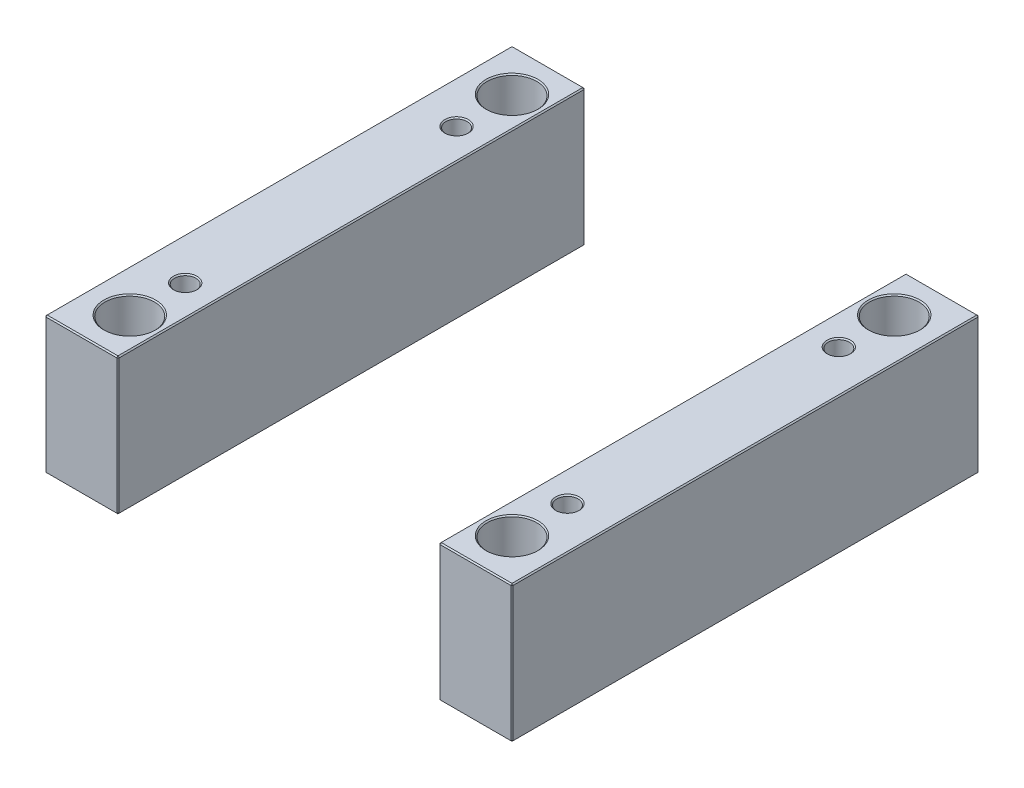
ISO-10303-21;
HEADER;
FILE_DESCRIPTION(('STEP AP214'),'2;1');
FILE_NAME('part.step','',(''),(''),'','','');
FILE_SCHEMA(('AUTOMOTIVE_DESIGN { 1 0 10303 214 1 1 1 1 }'));
ENDSEC;
DATA;
#1=APPLICATION_CONTEXT('core data for automotive mechanical design processes');
#2=APPLICATION_PROTOCOL_DEFINITION('international standard','automotive_design',2000,#1);
#3=PRODUCT_CONTEXT('',#1,'mechanical');
#4=PRODUCT('Part','Part','',(#3));
#5=PRODUCT_RELATED_PRODUCT_CATEGORY('part','',(#4));
#6=PRODUCT_DEFINITION_FORMATION('','',#4);
#7=PRODUCT_DEFINITION_CONTEXT('part definition',#1,'design');
#8=PRODUCT_DEFINITION('design','',#6,#7);
#9=PRODUCT_DEFINITION_SHAPE('','',#8);
#10=(LENGTH_UNIT() NAMED_UNIT(*) SI_UNIT(.MILLI.,.METRE.));
#11=(NAMED_UNIT(*) PLANE_ANGLE_UNIT() SI_UNIT($,.RADIAN.));
#12=(NAMED_UNIT(*) SI_UNIT($,.STERADIAN.) SOLID_ANGLE_UNIT());
#13=UNCERTAINTY_MEASURE_WITH_UNIT(LENGTH_MEASURE(1.E-05),#10,'distance_accuracy_value','');
#14=(GEOMETRIC_REPRESENTATION_CONTEXT(3) GLOBAL_UNCERTAINTY_ASSIGNED_CONTEXT((#13)) GLOBAL_UNIT_ASSIGNED_CONTEXT((#10,
#11,#12)) REPRESENTATION_CONTEXT('',''));
#15=CARTESIAN_POINT('',(0.,0.,0.));
#16=DIRECTION('',(0.,0.,1.));
#17=DIRECTION('',(1.,0.,0.));
#18=AXIS2_PLACEMENT_3D('',#15,#16,#17);
#19=CARTESIAN_POINT('',(-198.,116.,-198.));
#20=DIRECTION('',(0.,0.,1.));
#21=DIRECTION('',(1.,0.,0.));
#22=AXIS2_PLACEMENT_3D('',#19,#20,#21);
#23=PLANE('',#22);
#24=DIRECTION('',(-1.,0.,0.));
#25=VECTOR('',#24,1.);
#26=CARTESIAN_POINT('',(-198.,1.,-198.));
#27=LINE('',#26,#25);
#28=CARTESIAN_POINT('',(-137.,1.,-198.));
#29=VERTEX_POINT('',#28);
#30=CARTESIAN_POINT('',(-197.,1.,-198.));
#31=VERTEX_POINT('',#30);
#32=EDGE_CURVE('P0_E137',#29,#31,#27,.T.);
#33=ORIENTED_EDGE('',*,*,#32,.T.);
#34=DIRECTION('',(0.,1.,0.));
#35=VECTOR('',#34,1.);
#36=CARTESIAN_POINT('',(-197.,116.,-198.));
#37=LINE('',#36,#35);
#38=CARTESIAN_POINT('',(-197.,115.,-198.));
#39=VERTEX_POINT('',#38);
#40=EDGE_CURVE('P0_E265',#31,#39,#37,.T.);
#41=ORIENTED_EDGE('',*,*,#40,.T.);
#42=DIRECTION('',(1.,0.,0.));
#43=VECTOR('',#42,1.);
#44=CARTESIAN_POINT('',(-198.,115.,-198.));
#45=LINE('',#44,#43);
#46=CARTESIAN_POINT('',(-137.,115.,-198.));
#47=VERTEX_POINT('',#46);
#48=EDGE_CURVE('P0_E263',#39,#47,#45,.T.);
#49=ORIENTED_EDGE('',*,*,#48,.T.);
#50=DIRECTION('',(0.,-1.,0.));
#51=VECTOR('',#50,1.);
#52=CARTESIAN_POINT('',(-137.,116.,-198.));
#53=LINE('',#52,#51);
#54=EDGE_CURVE('P0_E260',#47,#29,#53,.T.);
#55=ORIENTED_EDGE('',*,*,#54,.T.);
#56=EDGE_LOOP('',(#33,#41,#49,#55));
#57=FACE_BOUND('',#56,.T.);
#58=ADVANCED_FACE('P0_F16',(#57),#23,.F.);
#59=CARTESIAN_POINT('',(-198.,116.,198.));
#60=DIRECTION('',(1.,0.,0.));
#61=DIRECTION('',(0.,0.,-1.));
#62=AXIS2_PLACEMENT_3D('',#59,#60,#61);
#63=PLANE('',#62);
#64=DIRECTION('',(0.,1.,0.));
#65=VECTOR('',#64,1.);
#66=CARTESIAN_POINT('',(-198.,116.,197.));
#67=LINE('',#66,#65);
#68=CARTESIAN_POINT('',(-198.,1.,197.));
#69=VERTEX_POINT('',#68);
#70=CARTESIAN_POINT('',(-198.,115.,197.));
#71=VERTEX_POINT('',#70);
#72=EDGE_CURVE('P0_E253',#69,#71,#67,.T.);
#73=ORIENTED_EDGE('',*,*,#72,.T.);
#74=DIRECTION('',(0.,0.,-1.));
#75=VECTOR('',#74,1.);
#76=CARTESIAN_POINT('',(-198.,115.,198.));
#77=LINE('',#76,#75);
#78=CARTESIAN_POINT('',(-198.,115.,-197.));
#79=VERTEX_POINT('',#78);
#80=EDGE_CURVE('P0_E258',#71,#79,#77,.T.);
#81=ORIENTED_EDGE('',*,*,#80,.T.);
#82=DIRECTION('',(0.,-1.,0.));
#83=VECTOR('',#82,1.);
#84=CARTESIAN_POINT('',(-198.,116.,-197.));
#85=LINE('',#84,#83);
#86=CARTESIAN_POINT('',(-198.,1.,-197.));
#87=VERTEX_POINT('',#86);
#88=EDGE_CURVE('P0_E255',#79,#87,#85,.T.);
#89=ORIENTED_EDGE('',*,*,#88,.T.);
#90=DIRECTION('',(0.,0.,1.));
#91=VECTOR('',#90,1.);
#92=CARTESIAN_POINT('',(-198.,1.,198.));
#93=LINE('',#92,#91);
#94=EDGE_CURVE('P0_E251',#87,#69,#93,.T.);
#95=ORIENTED_EDGE('',*,*,#94,.T.);
#96=EDGE_LOOP('',(#73,#81,#89,#95));
#97=FACE_BOUND('',#96,.T.);
#98=ADVANCED_FACE('P0_F333',(#97),#63,.F.);
#99=CARTESIAN_POINT('',(-198.,116.,198.));
#100=DIRECTION('',(0.,0.,-1.));
#101=DIRECTION('',(-1.,0.,0.));
#102=AXIS2_PLACEMENT_3D('',#99,#100,#101);
#103=PLANE('',#102);
#104=DIRECTION('',(-1.,0.,0.));
#105=VECTOR('',#104,1.);
#106=CARTESIAN_POINT('',(-198.,115.,198.));
#107=LINE('',#106,#105);
#108=CARTESIAN_POINT('',(-137.,115.,198.));
#109=VERTEX_POINT('',#108);
#110=CARTESIAN_POINT('',(-197.,115.,198.));
#111=VERTEX_POINT('',#110);
#112=EDGE_CURVE('P0_E272',#109,#111,#107,.T.);
#113=ORIENTED_EDGE('',*,*,#112,.T.);
#114=DIRECTION('',(0.,-1.,0.));
#115=VECTOR('',#114,1.);
#116=CARTESIAN_POINT('',(-197.,116.,198.));
#117=LINE('',#116,#115);
#118=CARTESIAN_POINT('',(-197.,1.,198.));
#119=VERTEX_POINT('',#118);
#120=EDGE_CURVE('P0_E274',#111,#119,#117,.T.);
#121=ORIENTED_EDGE('',*,*,#120,.T.);
#122=DIRECTION('',(1.,0.,0.));
#123=VECTOR('',#122,1.);
#124=CARTESIAN_POINT('',(-136.,1.,198.));
#125=LINE('',#124,#123);
#126=CARTESIAN_POINT('',(-137.,1.,198.));
#127=VERTEX_POINT('',#126);
#128=EDGE_CURVE('P0_E270',#119,#127,#125,.T.);
#129=ORIENTED_EDGE('',*,*,#128,.T.);
#130=DIRECTION('',(0.,1.,0.));
#131=VECTOR('',#130,1.);
#132=CARTESIAN_POINT('',(-137.,116.,198.));
#133=LINE('',#132,#131);
#134=EDGE_CURVE('P0_E268',#127,#109,#133,.T.);
#135=ORIENTED_EDGE('',*,*,#134,.T.);
#136=EDGE_LOOP('',(#113,#121,#129,#135));
#137=FACE_BOUND('',#136,.T.);
#138=ADVANCED_FACE('P0_F372',(#137),#103,.F.);
#139=CARTESIAN_POINT('',(-136.,116.,-198.));
#140=DIRECTION('',(-1.,0.,0.));
#141=DIRECTION('',(0.,0.,1.));
#142=AXIS2_PLACEMENT_3D('',#139,#140,#141);
#143=PLANE('',#142);
#144=DIRECTION('',(0.,0.,1.));
#145=VECTOR('',#144,1.);
#146=CARTESIAN_POINT('',(-136.,115.,-198.));
#147=LINE('',#146,#145);
#148=CARTESIAN_POINT('',(-136.,115.,-197.));
#149=VERTEX_POINT('',#148);
#150=CARTESIAN_POINT('',(-136.,115.,197.));
#151=VERTEX_POINT('',#150);
#152=EDGE_CURVE('P0_E31',#149,#151,#147,.T.);
#153=ORIENTED_EDGE('',*,*,#152,.T.);
#154=DIRECTION('',(0.,-1.,0.));
#155=VECTOR('',#154,1.);
#156=CARTESIAN_POINT('',(-136.,116.,197.));
#157=LINE('',#156,#155);
#158=CARTESIAN_POINT('',(-136.,1.,197.));
#159=VERTEX_POINT('',#158);
#160=EDGE_CURVE('P0_E190',#151,#159,#157,.T.);
#161=ORIENTED_EDGE('',*,*,#160,.T.);
#162=DIRECTION('',(0.,0.,-1.));
#163=VECTOR('',#162,1.);
#164=CARTESIAN_POINT('',(-136.,1.,-198.));
#165=LINE('',#164,#163);
#166=CARTESIAN_POINT('',(-136.,1.,-197.));
#167=VERTEX_POINT('',#166);
#168=EDGE_CURVE('P0_E286',#159,#167,#165,.T.);
#169=ORIENTED_EDGE('',*,*,#168,.T.);
#170=DIRECTION('',(0.,1.,0.));
#171=VECTOR('',#170,1.);
#172=CARTESIAN_POINT('',(-136.,116.,-197.));
#173=LINE('',#172,#171);
#174=EDGE_CURVE('P0_E36',#167,#149,#173,.T.);
#175=ORIENTED_EDGE('',*,*,#174,.T.);
#176=EDGE_LOOP('',(#153,#161,#169,#175));
#177=FACE_BOUND('',#176,.T.);
#178=ADVANCED_FACE('P0_F649',(#177),#143,.F.);
#179=CARTESIAN_POINT('',(0.,116.,0.));
#180=DIRECTION('',(0.,-1.,0.));
#181=DIRECTION('',(0.,0.,-1.));
#182=AXIS2_PLACEMENT_3D('',#179,#180,#181);
#183=PLANE('',#182);
#184=CARTESIAN_POINT('',(-162.,116.,-162.));
#185=DIRECTION('',(0.,-1.,0.));
#186=DIRECTION('',(0.,0.,-1.));
#187=AXIS2_PLACEMENT_3D('',#184,#185,#186);
#188=CIRCLE('',#187,22.);
#189=CARTESIAN_POINT('',(-162.,116.,-184.));
#190=VERTEX_POINT('',#189);
#191=EDGE_CURVE('P0_E214',#190,#190,#188,.T.);
#192=ORIENTED_EDGE('',*,*,#191,.T.);
#193=EDGE_LOOP('',(#192));
#194=FACE_BOUND('',#193,.T.);
#195=CARTESIAN_POINT('',(-162.,116.,162.));
#196=DIRECTION('',(0.,-1.,0.));
#197=DIRECTION('',(0.,0.,-1.));
#198=AXIS2_PLACEMENT_3D('',#195,#196,#197);
#199=CIRCLE('',#198,22.);
#200=CARTESIAN_POINT('',(-162.,116.,140.));
#201=VERTEX_POINT('',#200);
#202=EDGE_CURVE('P0_E211',#201,#201,#199,.T.);
#203=ORIENTED_EDGE('',*,*,#202,.T.);
#204=EDGE_LOOP('',(#203));
#205=FACE_BOUND('',#204,.T.);
#206=CARTESIAN_POINT('',(-162.,116.,115.));
#207=DIRECTION('',(0.,-1.,0.));
#208=DIRECTION('',(0.,0.,-1.));
#209=AXIS2_PLACEMENT_3D('',#206,#207,#208);
#210=CIRCLE('',#209,10.0000000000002);
#211=CARTESIAN_POINT('',(-162.,116.,105.));
#212=VERTEX_POINT('',#211);
#213=EDGE_CURVE('P0_E193',#212,#212,#210,.T.);
#214=ORIENTED_EDGE('',*,*,#213,.T.);
#215=EDGE_LOOP('',(#214));
#216=FACE_BOUND('',#215,.T.);
#217=CARTESIAN_POINT('',(-162.,116.,-115.));
#218=DIRECTION('',(0.,-1.,0.));
#219=DIRECTION('',(0.,0.,-1.));
#220=AXIS2_PLACEMENT_3D('',#217,#218,#219);
#221=CIRCLE('',#220,10.0000000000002);
#222=CARTESIAN_POINT('',(-162.,116.,-125.));
#223=VERTEX_POINT('',#222);
#224=EDGE_CURVE('P0_E189',#223,#223,#221,.T.);
#225=ORIENTED_EDGE('',*,*,#224,.T.);
#226=EDGE_LOOP('',(#225));
#227=FACE_BOUND('',#226,.T.);
#228=DIRECTION('',(0.,0.,1.));
#229=VECTOR('',#228,1.);
#230=CARTESIAN_POINT('',(-197.,116.,0.));
#231=LINE('',#230,#229);
#232=CARTESIAN_POINT('',(-197.,116.,-197.));
#233=VERTEX_POINT('',#232);
#234=CARTESIAN_POINT('',(-197.,116.,197.));
#235=VERTEX_POINT('',#234);
#236=EDGE_CURVE('P0_E281',#233,#235,#231,.T.);
#237=ORIENTED_EDGE('',*,*,#236,.T.);
#238=DIRECTION('',(1.,0.,0.));
#239=VECTOR('',#238,1.);
#240=CARTESIAN_POINT('',(-1.76382206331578E-13,116.,197.));
#241=LINE('',#240,#239);
#242=CARTESIAN_POINT('',(-137.,116.,197.));
#243=VERTEX_POINT('',#242);
#244=EDGE_CURVE('P0_E283',#235,#243,#241,.T.);
#245=ORIENTED_EDGE('',*,*,#244,.T.);
#246=DIRECTION('',(0.,0.,-1.));
#247=VECTOR('',#246,1.);
#248=CARTESIAN_POINT('',(-137.,116.,0.));
#249=LINE('',#248,#247);
#250=CARTESIAN_POINT('',(-137.,116.,-197.));
#251=VERTEX_POINT('',#250);
#252=EDGE_CURVE('P0_E277',#243,#251,#249,.T.);
#253=ORIENTED_EDGE('',*,*,#252,.T.);
#254=DIRECTION('',(-1.,0.,0.));
#255=VECTOR('',#254,1.);
#256=CARTESIAN_POINT('',(1.76382206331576E-13,116.,-197.));
#257=LINE('',#256,#255);
#258=EDGE_CURVE('P0_E279',#251,#233,#257,.T.);
#259=ORIENTED_EDGE('',*,*,#258,.T.);
#260=EDGE_LOOP('',(#237,#245,#253,#259));
#261=FACE_BOUND('',#260,.T.);
#262=ADVANCED_FACE('P0_F229',(#194,#205,#216,#227,#261),#183,.F.);
#263=CARTESIAN_POINT('',(0.,0.,0.));
#264=DIRECTION('',(0.,-1.,0.));
#265=DIRECTION('',(0.,0.,-1.));
#266=AXIS2_PLACEMENT_3D('',#263,#264,#265);
#267=PLANE('',#266);
#268=CARTESIAN_POINT('',(-162.,0.,-162.));
#269=DIRECTION('',(0.,-1.,0.));
#270=DIRECTION('',(0.,0.,-1.));
#271=AXIS2_PLACEMENT_3D('',#268,#269,#270);
#272=CIRCLE('',#271,21.9999999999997);
#273=CARTESIAN_POINT('',(-162.,0.,-184.));
#274=VERTEX_POINT('',#273);
#275=EDGE_CURVE('P0_E202',#274,#274,#272,.F.);
#276=ORIENTED_EDGE('',*,*,#275,.T.);
#277=EDGE_LOOP('',(#276));
#278=FACE_BOUND('',#277,.T.);
#279=CARTESIAN_POINT('',(-162.,0.,162.));
#280=DIRECTION('',(0.,-1.,0.));
#281=DIRECTION('',(0.,0.,-1.));
#282=AXIS2_PLACEMENT_3D('',#279,#280,#281);
#283=CIRCLE('',#282,22.);
#284=CARTESIAN_POINT('',(-162.,0.,140.));
#285=VERTEX_POINT('',#284);
#286=EDGE_CURVE('P0_E199',#285,#285,#283,.F.);
#287=ORIENTED_EDGE('',*,*,#286,.T.);
#288=EDGE_LOOP('',(#287));
#289=FACE_BOUND('',#288,.T.);
#290=CARTESIAN_POINT('',(-162.,0.,-115.));
#291=DIRECTION('',(0.,-1.,0.));
#292=DIRECTION('',(0.,0.,-1.));
#293=AXIS2_PLACEMENT_3D('',#290,#291,#292);
#294=CIRCLE('',#293,9.99999999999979);
#295=CARTESIAN_POINT('',(-162.,0.,-125.));
#296=VERTEX_POINT('',#295);
#297=EDGE_CURVE('P0_E235',#296,#296,#294,.F.);
#298=ORIENTED_EDGE('',*,*,#297,.T.);
#299=EDGE_LOOP('',(#298));
#300=FACE_BOUND('',#299,.T.);
#301=CARTESIAN_POINT('',(-162.,0.,115.));
#302=DIRECTION('',(0.,-1.,0.));
#303=DIRECTION('',(0.,0.,-1.));
#304=AXIS2_PLACEMENT_3D('',#301,#302,#303);
#305=CIRCLE('',#304,9.99999999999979);
#306=CARTESIAN_POINT('',(-162.,0.,105.));
#307=VERTEX_POINT('',#306);
#308=EDGE_CURVE('P0_E238',#307,#307,#305,.F.);
#309=ORIENTED_EDGE('',*,*,#308,.T.);
#310=EDGE_LOOP('',(#309));
#311=FACE_BOUND('',#310,.T.);
#312=DIRECTION('',(-1.,0.,0.));
#313=VECTOR('',#312,1.);
#314=CARTESIAN_POINT('',(-198.,0.,197.));
#315=LINE('',#314,#313);
#316=CARTESIAN_POINT('',(-137.,0.,197.));
#317=VERTEX_POINT('',#316);
#318=CARTESIAN_POINT('',(-197.,0.,197.));
#319=VERTEX_POINT('',#318);
#320=EDGE_CURVE('P0_E114',#317,#319,#315,.T.);
#321=ORIENTED_EDGE('',*,*,#320,.T.);
#322=DIRECTION('',(0.,0.,-1.));
#323=VECTOR('',#322,1.);
#324=CARTESIAN_POINT('',(-197.,0.,-198.));
#325=LINE('',#324,#323);
#326=CARTESIAN_POINT('',(-197.,0.,-197.));
#327=VERTEX_POINT('',#326);
#328=EDGE_CURVE('P0_E110',#319,#327,#325,.T.);
#329=ORIENTED_EDGE('',*,*,#328,.T.);
#330=DIRECTION('',(1.,0.,0.));
#331=VECTOR('',#330,1.);
#332=CARTESIAN_POINT('',(-136.,0.,-197.));
#333=LINE('',#332,#331);
#334=CARTESIAN_POINT('',(-137.,0.,-197.));
#335=VERTEX_POINT('',#334);
#336=EDGE_CURVE('P0_E104',#327,#335,#333,.T.);
#337=ORIENTED_EDGE('',*,*,#336,.T.);
#338=DIRECTION('',(0.,0.,1.));
#339=VECTOR('',#338,1.);
#340=CARTESIAN_POINT('',(-137.,0.,198.));
#341=LINE('',#340,#339);
#342=EDGE_CURVE('P0_E107',#335,#317,#341,.T.);
#343=ORIENTED_EDGE('',*,*,#342,.T.);
#344=EDGE_LOOP('',(#321,#329,#337,#343));
#345=FACE_BOUND('',#344,.T.);
#346=ADVANCED_FACE('P0_F106',(#278,#289,#300,#311,#345),#267,.T.);
#347=CARTESIAN_POINT('',(-162.,0.,-115.));
#348=DIRECTION('',(0.,1.,0.));
#349=DIRECTION('',(0.,0.,1.));
#350=AXIS2_PLACEMENT_3D('',#347,#348,#349);
#351=CYLINDRICAL_SURFACE('',#350,9.);
#352=CARTESIAN_POINT('',(-162.,115.,-115.));
#353=DIRECTION('',(0.,-1.,0.));
#354=DIRECTION('',(0.,0.,-1.));
#355=AXIS2_PLACEMENT_3D('',#352,#353,#354);
#356=CIRCLE('',#355,9.);
#357=CARTESIAN_POINT('',(-162.,115.,-124.));
#358=VERTEX_POINT('',#357);
#359=EDGE_CURVE('P0_E196',#358,#358,#356,.F.);
#360=ORIENTED_EDGE('',*,*,#359,.T.);
#361=EDGE_LOOP('',(#360));
#362=FACE_BOUND('',#361,.T.);
#363=CARTESIAN_POINT('',(-162.,0.999999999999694,-115.));
#364=DIRECTION('',(0.,-1.,0.));
#365=DIRECTION('',(0.,0.,-1.));
#366=AXIS2_PLACEMENT_3D('',#363,#364,#365);
#367=CIRCLE('',#366,9.);
#368=CARTESIAN_POINT('',(-162.,0.999999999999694,-124.));
#369=VERTEX_POINT('',#368);
#370=EDGE_CURVE('P0_E241',#369,#369,#367,.T.);
#371=ORIENTED_EDGE('',*,*,#370,.T.);
#372=EDGE_LOOP('',(#371));
#373=FACE_BOUND('',#372,.T.);
#374=ADVANCED_FACE('P0_F228',(#362,#373),#351,.F.);
#375=CARTESIAN_POINT('',(-162.,0.,115.));
#376=DIRECTION('',(0.,1.,0.));
#377=DIRECTION('',(0.,0.,1.));
#378=AXIS2_PLACEMENT_3D('',#375,#376,#377);
#379=CYLINDRICAL_SURFACE('',#378,9.);
#380=CARTESIAN_POINT('',(-162.,115.,115.));
#381=DIRECTION('',(0.,-1.,0.));
#382=DIRECTION('',(0.,0.,-1.));
#383=AXIS2_PLACEMENT_3D('',#380,#381,#382);
#384=CIRCLE('',#383,9.);
#385=CARTESIAN_POINT('',(-162.,115.,106.));
#386=VERTEX_POINT('',#385);
#387=EDGE_CURVE('P0_E186',#386,#386,#384,.F.);
#388=ORIENTED_EDGE('',*,*,#387,.T.);
#389=EDGE_LOOP('',(#388));
#390=FACE_BOUND('',#389,.T.);
#391=CARTESIAN_POINT('',(-162.,0.999999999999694,115.));
#392=DIRECTION('',(0.,-1.,0.));
#393=DIRECTION('',(0.,0.,-1.));
#394=AXIS2_PLACEMENT_3D('',#391,#392,#393);
#395=CIRCLE('',#394,9.);
#396=CARTESIAN_POINT('',(-162.,0.999999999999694,106.));
#397=VERTEX_POINT('',#396);
#398=EDGE_CURVE('P0_E248',#397,#397,#395,.T.);
#399=ORIENTED_EDGE('',*,*,#398,.T.);
#400=EDGE_LOOP('',(#399));
#401=FACE_BOUND('',#400,.T.);
#402=ADVANCED_FACE('P0_F380',(#390,#401),#379,.F.);
#403=CARTESIAN_POINT('',(-162.,0.,-115.));
#404=DIRECTION('',(0.,-1.,0.));
#405=DIRECTION('',(0.,0.,-1.));
#406=AXIS2_PLACEMENT_3D('',#403,#404,#405);
#407=CONICAL_SURFACE('',#406,9.99999999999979,0.785398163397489);
#408=ORIENTED_EDGE('',*,*,#370,.F.);
#409=EDGE_LOOP('',(#408));
#410=FACE_BOUND('',#409,.T.);
#411=ORIENTED_EDGE('',*,*,#297,.F.);
#412=EDGE_LOOP('',(#411));
#413=FACE_BOUND('',#412,.T.);
#414=ADVANCED_FACE('P0_F376',(#410,#413),#407,.F.);
#415=CARTESIAN_POINT('',(-162.,0.,115.));
#416=DIRECTION('',(0.,-1.,0.));
#417=DIRECTION('',(0.,0.,-1.));
#418=AXIS2_PLACEMENT_3D('',#415,#416,#417);
#419=CONICAL_SURFACE('',#418,9.99999999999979,0.785398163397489);
#420=ORIENTED_EDGE('',*,*,#398,.F.);
#421=EDGE_LOOP('',(#420));
#422=FACE_BOUND('',#421,.T.);
#423=ORIENTED_EDGE('',*,*,#308,.F.);
#424=EDGE_LOOP('',(#423));
#425=FACE_BOUND('',#424,.T.);
#426=ADVANCED_FACE('P0_F379',(#422,#425),#419,.F.);
#427=CARTESIAN_POINT('',(-136.,116.,197.));
#428=DIRECTION('',(-0.707106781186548,0.,-0.707106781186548));
#429=DIRECTION('',(0.,-1.,0.));
#430=AXIS2_PLACEMENT_3D('',#427,#428,#429);
#431=PLANE('',#430);
#432=DIRECTION('',(-0.707106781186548,0.,0.707106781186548));
#433=VECTOR('',#432,1.);
#434=CARTESIAN_POINT('',(-136.5,115.,197.5));
#435=LINE('',#434,#433);
#436=EDGE_CURVE('P0_E125',#109,#151,#435,.F.);
#437=ORIENTED_EDGE('',*,*,#436,.F.);
#438=ORIENTED_EDGE('',*,*,#134,.F.);
#439=DIRECTION('',(0.707106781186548,0.,-0.707106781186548));
#440=VECTOR('',#439,1.);
#441=CARTESIAN_POINT('',(-137.,1.,198.));
#442=LINE('',#441,#440);
#443=EDGE_CURVE('P0_E181',#159,#127,#442,.F.);
#444=ORIENTED_EDGE('',*,*,#443,.F.);
#445=ORIENTED_EDGE('',*,*,#160,.F.);
#446=EDGE_LOOP('',(#437,#438,#444,#445));
#447=FACE_BOUND('',#446,.T.);
#448=ADVANCED_FACE('P0_F384',(#447),#431,.F.);
#449=CARTESIAN_POINT('',(-137.,116.,197.));
#450=DIRECTION('',(0.577350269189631,0.577350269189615,0.577350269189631));
#451=DIRECTION('',(0.707106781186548,0.,-0.707106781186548));
#452=AXIS2_PLACEMENT_3D('',#449,#450,#451);
#453=PLANE('',#452);
#454=DIRECTION('',(0.,0.707106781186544,-0.707106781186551));
#455=VECTOR('',#454,1.);
#456=CARTESIAN_POINT('',(-137.,116.,197.));
#457=LINE('',#456,#455);
#458=EDGE_CURVE('P0_E175',#109,#243,#457,.T.);
#459=ORIENTED_EDGE('',*,*,#458,.F.);
#460=ORIENTED_EDGE('',*,*,#436,.T.);
#461=DIRECTION('',(0.707106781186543,-0.707106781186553,0.));
#462=VECTOR('',#461,1.);
#463=CARTESIAN_POINT('',(-137.,116.,197.));
#464=LINE('',#463,#462);
#465=EDGE_CURVE('P0_E178',#243,#151,#464,.T.);
#466=ORIENTED_EDGE('',*,*,#465,.F.);
#467=EDGE_LOOP('',(#459,#460,#466));
#468=FACE_BOUND('',#467,.T.);
#469=ADVANCED_FACE('P0_F588',(#468),#453,.T.);
#470=CARTESIAN_POINT('',(-137.,1.,198.));
#471=DIRECTION('',(0.577350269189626,-0.577350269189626,0.577350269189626));
#472=DIRECTION('',(0.707106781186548,0.,-0.707106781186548));
#473=AXIS2_PLACEMENT_3D('',#470,#471,#472);
#474=PLANE('',#473);
#475=DIRECTION('',(0.707106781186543,0.707106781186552,0.));
#476=VECTOR('',#475,1.);
#477=CARTESIAN_POINT('',(-136.5,0.500000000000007,197.));
#478=LINE('',#477,#476);
#479=EDGE_CURVE('P0_E123',#159,#317,#478,.F.);
#480=ORIENTED_EDGE('',*,*,#479,.F.);
#481=ORIENTED_EDGE('',*,*,#443,.T.);
#482=DIRECTION('',(0.,-0.707106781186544,-0.707106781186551));
#483=VECTOR('',#482,1.);
#484=CARTESIAN_POINT('',(-137.,1.,198.));
#485=LINE('',#484,#483);
#486=EDGE_CURVE('P0_E172',#317,#127,#485,.F.);
#487=ORIENTED_EDGE('',*,*,#486,.F.);
#488=EDGE_LOOP('',(#480,#481,#487));
#489=FACE_BOUND('',#488,.T.);
#490=ADVANCED_FACE('P0_F597',(#489),#474,.T.);
#491=CARTESIAN_POINT('',(-137.,116.,0.));
#492=DIRECTION('',(-0.707106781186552,-0.707106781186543,0.));
#493=DIRECTION('',(0.,0.,-1.));
#494=AXIS2_PLACEMENT_3D('',#491,#492,#493);
#495=PLANE('',#494);
#496=ORIENTED_EDGE('',*,*,#465,.T.);
#497=ORIENTED_EDGE('',*,*,#152,.F.);
#498=DIRECTION('',(-0.707106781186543,0.707106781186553,0.));
#499=VECTOR('',#498,1.);
#500=CARTESIAN_POINT('',(-136.5,115.5,-197.));
#501=LINE('',#500,#499);
#502=EDGE_CURVE('P0_E165',#251,#149,#501,.F.);
#503=ORIENTED_EDGE('',*,*,#502,.F.);
#504=ORIENTED_EDGE('',*,*,#252,.F.);
#505=EDGE_LOOP('',(#496,#497,#503,#504));
#506=FACE_BOUND('',#505,.T.);
#507=ADVANCED_FACE('P0_F349',(#506),#495,.F.);
#508=CARTESIAN_POINT('',(-1.76382206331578E-13,116.,197.));
#509=DIRECTION('',(0.,-0.707106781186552,-0.707106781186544));
#510=DIRECTION('',(1.,0.,0.));
#511=AXIS2_PLACEMENT_3D('',#508,#509,#510);
#512=PLANE('',#511);
#513=ORIENTED_EDGE('',*,*,#458,.T.);
#514=ORIENTED_EDGE('',*,*,#244,.F.);
#515=DIRECTION('',(0.,-0.707106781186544,0.707106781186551));
#516=VECTOR('',#515,1.);
#517=CARTESIAN_POINT('',(-197.,115.5,197.5));
#518=LINE('',#517,#516);
#519=EDGE_CURVE('P0_E162',#111,#235,#518,.F.);
#520=ORIENTED_EDGE('',*,*,#519,.F.);
#521=ORIENTED_EDGE('',*,*,#112,.F.);
#522=EDGE_LOOP('',(#513,#514,#520,#521));
#523=FACE_BOUND('',#522,.T.);
#524=ADVANCED_FACE('P0_F344',(#523),#512,.F.);
#525=CARTESIAN_POINT('',(-197.,116.,198.));
#526=DIRECTION('',(0.707106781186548,0.,-0.707106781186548));
#527=DIRECTION('',(0.,-1.,0.));
#528=AXIS2_PLACEMENT_3D('',#525,#526,#527);
#529=PLANE('',#528);
#530=DIRECTION('',(0.707106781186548,0.,0.707106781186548));
#531=VECTOR('',#530,1.);
#532=CARTESIAN_POINT('',(-197.,1.,198.));
#533=LINE('',#532,#531);
#534=EDGE_CURVE('P0_E156',#119,#69,#533,.F.);
#535=ORIENTED_EDGE('',*,*,#534,.F.);
#536=ORIENTED_EDGE('',*,*,#120,.F.);
#537=DIRECTION('',(-0.707106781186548,0.,-0.707106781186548));
#538=VECTOR('',#537,1.);
#539=CARTESIAN_POINT('',(-198.,115.,197.));
#540=LINE('',#539,#538);
#541=EDGE_CURVE('P0_E159',#71,#111,#540,.F.);
#542=ORIENTED_EDGE('',*,*,#541,.F.);
#543=ORIENTED_EDGE('',*,*,#72,.F.);
#544=EDGE_LOOP('',(#535,#536,#542,#543));
#545=FACE_BOUND('',#544,.T.);
#546=ADVANCED_FACE('P0_F338',(#545),#529,.F.);
#547=CARTESIAN_POINT('',(-198.,1.,198.));
#548=DIRECTION('',(0.,-0.707106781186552,0.707106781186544));
#549=DIRECTION('',(-1.,0.,0.));
#550=AXIS2_PLACEMENT_3D('',#547,#548,#549);
#551=PLANE('',#550);
#552=ORIENTED_EDGE('',*,*,#486,.T.);
#553=ORIENTED_EDGE('',*,*,#128,.F.);
#554=DIRECTION('',(0.,0.707106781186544,0.707106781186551));
#555=VECTOR('',#554,1.);
#556=CARTESIAN_POINT('',(-197.,1.,198.));
#557=LINE('',#556,#555);
#558=EDGE_CURVE('P0_E134',#319,#119,#557,.T.);
#559=ORIENTED_EDGE('',*,*,#558,.F.);
#560=ORIENTED_EDGE('',*,*,#320,.F.);
#561=EDGE_LOOP('',(#552,#553,#559,#560));
#562=FACE_BOUND('',#561,.T.);
#563=ADVANCED_FACE('P0_F364',(#562),#551,.T.);
#564=CARTESIAN_POINT('',(-136.,1.,-198.));
#565=DIRECTION('',(0.707106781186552,-0.707106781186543,0.));
#566=DIRECTION('',(0.,0.,1.));
#567=AXIS2_PLACEMENT_3D('',#564,#565,#566);
#568=PLANE('',#567);
#569=ORIENTED_EDGE('',*,*,#479,.T.);
#570=ORIENTED_EDGE('',*,*,#342,.F.);
#571=DIRECTION('',(-0.707106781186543,-0.707106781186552,0.));
#572=VECTOR('',#571,1.);
#573=CARTESIAN_POINT('',(-137.,0.,-197.));
#574=LINE('',#573,#572);
#575=EDGE_CURVE('P0_E120',#167,#335,#574,.T.);
#576=ORIENTED_EDGE('',*,*,#575,.F.);
#577=ORIENTED_EDGE('',*,*,#168,.F.);
#578=EDGE_LOOP('',(#569,#570,#576,#577));
#579=FACE_BOUND('',#578,.T.);
#580=ADVANCED_FACE('P0_F119',(#579),#568,.T.);
#581=CARTESIAN_POINT('',(-137.,116.,-198.));
#582=DIRECTION('',(-0.707106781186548,0.,0.707106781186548));
#583=DIRECTION('',(0.,-1.,0.));
#584=AXIS2_PLACEMENT_3D('',#581,#582,#583);
#585=PLANE('',#584);
#586=DIRECTION('',(0.707106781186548,0.,0.707106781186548));
#587=VECTOR('',#586,1.);
#588=CARTESIAN_POINT('',(-137.,115.,-198.));
#589=LINE('',#588,#587);
#590=EDGE_CURVE('P0_E168',#149,#47,#589,.F.);
#591=ORIENTED_EDGE('',*,*,#590,.F.);
#592=ORIENTED_EDGE('',*,*,#174,.F.);
#593=DIRECTION('',(-0.707106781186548,0.,-0.707106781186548));
#594=VECTOR('',#593,1.);
#595=CARTESIAN_POINT('',(-136.5,1.,-197.5));
#596=LINE('',#595,#594);
#597=EDGE_CURVE('P0_E133',#29,#167,#596,.F.);
#598=ORIENTED_EDGE('',*,*,#597,.F.);
#599=ORIENTED_EDGE('',*,*,#54,.F.);
#600=EDGE_LOOP('',(#591,#592,#598,#599));
#601=FACE_BOUND('',#600,.T.);
#602=ADVANCED_FACE('P0_F354',(#601),#585,.F.);
#603=CARTESIAN_POINT('',(-137.,115.,-198.));
#604=DIRECTION('',(0.577350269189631,0.577350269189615,-0.577350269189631));
#605=DIRECTION('',(-0.707106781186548,0.,-0.707106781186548));
#606=AXIS2_PLACEMENT_3D('',#603,#604,#605);
#607=PLANE('',#606);
#608=ORIENTED_EDGE('',*,*,#502,.T.);
#609=ORIENTED_EDGE('',*,*,#590,.T.);
#610=DIRECTION('',(0.,-0.707106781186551,-0.707106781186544));
#611=VECTOR('',#610,1.);
#612=CARTESIAN_POINT('',(-137.,115.,-198.));
#613=LINE('',#612,#611);
#614=EDGE_CURVE('P0_E151',#251,#47,#613,.T.);
#615=ORIENTED_EDGE('',*,*,#614,.F.);
#616=EDGE_LOOP('',(#608,#609,#615));
#617=FACE_BOUND('',#616,.T.);
#618=ADVANCED_FACE('P0_F352',(#617),#607,.T.);
#619=CARTESIAN_POINT('',(-198.,115.,197.));
#620=DIRECTION('',(-0.577350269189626,0.577350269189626,0.577350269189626));
#621=DIRECTION('',(0.707106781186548,0.,0.707106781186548));
#622=AXIS2_PLACEMENT_3D('',#619,#620,#621);
#623=PLANE('',#622);
#624=ORIENTED_EDGE('',*,*,#541,.T.);
#625=ORIENTED_EDGE('',*,*,#519,.T.);
#626=DIRECTION('',(0.707106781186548,0.707106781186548,0.));
#627=VECTOR('',#626,1.);
#628=CARTESIAN_POINT('',(-198.,115.,197.));
#629=LINE('',#628,#627);
#630=EDGE_CURVE('P0_E142',#71,#235,#629,.T.);
#631=ORIENTED_EDGE('',*,*,#630,.F.);
#632=EDGE_LOOP('',(#624,#625,#631));
#633=FACE_BOUND('',#632,.T.);
#634=ADVANCED_FACE('P0_F341',(#633),#623,.T.);
#635=CARTESIAN_POINT('',(-197.,1.,198.));
#636=DIRECTION('',(-0.577350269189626,-0.577350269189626,0.577350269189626));
#637=DIRECTION('',(0.707106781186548,0.,0.707106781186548));
#638=AXIS2_PLACEMENT_3D('',#635,#636,#637);
#639=PLANE('',#638);
#640=ORIENTED_EDGE('',*,*,#558,.T.);
#641=ORIENTED_EDGE('',*,*,#534,.T.);
#642=DIRECTION('',(0.707106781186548,-0.707106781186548,0.));
#643=VECTOR('',#642,1.);
#644=CARTESIAN_POINT('',(-197.5,0.5,197.));
#645=LINE('',#644,#643);
#646=EDGE_CURVE('P0_E138',#319,#69,#645,.F.);
#647=ORIENTED_EDGE('',*,*,#646,.F.);
#648=EDGE_LOOP('',(#640,#641,#647));
#649=FACE_BOUND('',#648,.T.);
#650=ADVANCED_FACE('P0_F403',(#649),#639,.T.);
#651=CARTESIAN_POINT('',(-137.,0.,-197.));
#652=DIRECTION('',(0.577350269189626,-0.577350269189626,-0.577350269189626));
#653=DIRECTION('',(-0.707106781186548,0.,-0.707106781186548));
#654=AXIS2_PLACEMENT_3D('',#651,#652,#653);
#655=PLANE('',#654);
#656=ORIENTED_EDGE('',*,*,#597,.T.);
#657=ORIENTED_EDGE('',*,*,#575,.T.);
#658=DIRECTION('',(0.,0.707106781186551,-0.707106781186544));
#659=VECTOR('',#658,1.);
#660=CARTESIAN_POINT('',(-137.,0.,-197.));
#661=LINE('',#660,#659);
#662=EDGE_CURVE('P0_E130',#29,#335,#661,.F.);
#663=ORIENTED_EDGE('',*,*,#662,.F.);
#664=EDGE_LOOP('',(#656,#657,#663));
#665=FACE_BOUND('',#664,.T.);
#666=ADVANCED_FACE('P0_F129',(#665),#655,.T.);
#667=CARTESIAN_POINT('',(1.76382206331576E-13,116.,-197.));
#668=DIRECTION('',(0.,-0.707106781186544,0.707106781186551));
#669=DIRECTION('',(-1.,0.,0.));
#670=AXIS2_PLACEMENT_3D('',#667,#668,#669);
#671=PLANE('',#670);
#672=ORIENTED_EDGE('',*,*,#614,.T.);
#673=ORIENTED_EDGE('',*,*,#48,.F.);
#674=DIRECTION('',(0.,0.707106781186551,0.707106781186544));
#675=VECTOR('',#674,1.);
#676=CARTESIAN_POINT('',(-197.,115.,-198.));
#677=LINE('',#676,#675);
#678=EDGE_CURVE('P0_E139',#233,#39,#677,.F.);
#679=ORIENTED_EDGE('',*,*,#678,.F.);
#680=ORIENTED_EDGE('',*,*,#258,.F.);
#681=EDGE_LOOP('',(#672,#673,#679,#680));
#682=FACE_BOUND('',#681,.T.);
#683=ADVANCED_FACE('P0_F316',(#682),#671,.F.);
#684=CARTESIAN_POINT('',(-197.,116.,0.));
#685=DIRECTION('',(0.707106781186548,-0.707106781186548,0.));
#686=DIRECTION('',(0.,0.,1.));
#687=AXIS2_PLACEMENT_3D('',#684,#685,#686);
#688=PLANE('',#687);
#689=ORIENTED_EDGE('',*,*,#630,.T.);
#690=ORIENTED_EDGE('',*,*,#236,.F.);
#691=DIRECTION('',(-0.707106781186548,-0.707106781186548,0.));
#692=VECTOR('',#691,1.);
#693=CARTESIAN_POINT('',(-197.5,115.5,-197.));
#694=LINE('',#693,#692);
#695=EDGE_CURVE('P0_E145',#79,#233,#694,.F.);
#696=ORIENTED_EDGE('',*,*,#695,.F.);
#697=ORIENTED_EDGE('',*,*,#80,.F.);
#698=EDGE_LOOP('',(#689,#690,#696,#697));
#699=FACE_BOUND('',#698,.T.);
#700=ADVANCED_FACE('P0_F310',(#699),#688,.F.);
#701=CARTESIAN_POINT('',(-198.,1.,198.));
#702=DIRECTION('',(-0.707106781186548,-0.707106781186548,0.));
#703=DIRECTION('',(0.,0.,-1.));
#704=AXIS2_PLACEMENT_3D('',#701,#702,#703);
#705=PLANE('',#704);
#706=ORIENTED_EDGE('',*,*,#646,.T.);
#707=ORIENTED_EDGE('',*,*,#94,.F.);
#708=DIRECTION('',(-0.707106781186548,0.707106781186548,0.));
#709=VECTOR('',#708,1.);
#710=CARTESIAN_POINT('',(-198.,1.,-197.));
#711=LINE('',#710,#709);
#712=EDGE_CURVE('P0_E297',#327,#87,#711,.T.);
#713=ORIENTED_EDGE('',*,*,#712,.F.);
#714=ORIENTED_EDGE('',*,*,#328,.F.);
#715=EDGE_LOOP('',(#706,#707,#713,#714));
#716=FACE_BOUND('',#715,.T.);
#717=ADVANCED_FACE('P0_F329',(#716),#705,.T.);
#718=CARTESIAN_POINT('',(-198.,1.,-198.));
#719=DIRECTION('',(0.,-0.707106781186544,-0.707106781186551));
#720=DIRECTION('',(1.,0.,0.));
#721=AXIS2_PLACEMENT_3D('',#718,#719,#720);
#722=PLANE('',#721);
#723=ORIENTED_EDGE('',*,*,#662,.T.);
#724=ORIENTED_EDGE('',*,*,#336,.F.);
#725=DIRECTION('',(0.,-0.707106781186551,0.707106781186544));
#726=VECTOR('',#725,1.);
#727=CARTESIAN_POINT('',(-197.,0.500000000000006,-197.5));
#728=LINE('',#727,#726);
#729=EDGE_CURVE('P0_E295',#31,#327,#728,.T.);
#730=ORIENTED_EDGE('',*,*,#729,.F.);
#731=ORIENTED_EDGE('',*,*,#32,.F.);
#732=EDGE_LOOP('',(#723,#724,#730,#731));
#733=FACE_BOUND('',#732,.T.);
#734=ADVANCED_FACE('P0_F136',(#733),#722,.T.);
#735=CARTESIAN_POINT('',(-197.,115.,-198.));
#736=DIRECTION('',(-0.577350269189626,0.577350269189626,-0.577350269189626));
#737=DIRECTION('',(-0.707106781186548,0.,0.707106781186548));
#738=AXIS2_PLACEMENT_3D('',#735,#736,#737);
#739=PLANE('',#738);
#740=ORIENTED_EDGE('',*,*,#695,.T.);
#741=ORIENTED_EDGE('',*,*,#678,.T.);
#742=DIRECTION('',(0.707106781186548,0.,-0.707106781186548));
#743=VECTOR('',#742,1.);
#744=CARTESIAN_POINT('',(-197.,115.,-198.));
#745=LINE('',#744,#743);
#746=EDGE_CURVE('P0_E293',#79,#39,#745,.T.);
#747=ORIENTED_EDGE('',*,*,#746,.F.);
#748=EDGE_LOOP('',(#740,#741,#747));
#749=FACE_BOUND('',#748,.T.);
#750=ADVANCED_FACE('P0_F303',(#749),#739,.T.);
#751=CARTESIAN_POINT('',(-198.,1.,-197.));
#752=DIRECTION('',(-0.577350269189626,-0.577350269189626,-0.577350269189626));
#753=DIRECTION('',(-0.707106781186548,0.,0.707106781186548));
#754=AXIS2_PLACEMENT_3D('',#751,#752,#753);
#755=PLANE('',#754);
#756=ORIENTED_EDGE('',*,*,#729,.T.);
#757=ORIENTED_EDGE('',*,*,#712,.T.);
#758=DIRECTION('',(-0.707106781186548,0.,0.707106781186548));
#759=VECTOR('',#758,1.);
#760=CARTESIAN_POINT('',(-198.,1.,-197.));
#761=LINE('',#760,#759);
#762=EDGE_CURVE('P0_E291',#31,#87,#761,.T.);
#763=ORIENTED_EDGE('',*,*,#762,.F.);
#764=EDGE_LOOP('',(#756,#757,#763));
#765=FACE_BOUND('',#764,.T.);
#766=ADVANCED_FACE('P0_F325',(#765),#755,.T.);
#767=CARTESIAN_POINT('',(-198.,116.,-197.));
#768=DIRECTION('',(0.707106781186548,0.,0.707106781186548));
#769=DIRECTION('',(0.,-1.,0.));
#770=AXIS2_PLACEMENT_3D('',#767,#768,#769);
#771=PLANE('',#770);
#772=ORIENTED_EDGE('',*,*,#746,.T.);
#773=ORIENTED_EDGE('',*,*,#40,.F.);
#774=ORIENTED_EDGE('',*,*,#762,.T.);
#775=ORIENTED_EDGE('',*,*,#88,.F.);
#776=EDGE_LOOP('',(#772,#773,#774,#775));
#777=FACE_BOUND('',#776,.T.);
#778=ADVANCED_FACE('P0_F323',(#777),#771,.F.);
#779=CARTESIAN_POINT('',(-162.,115.,115.));
#780=DIRECTION('',(0.,1.,0.));
#781=DIRECTION('',(0.,0.,1.));
#782=AXIS2_PLACEMENT_3D('',#779,#780,#781);
#783=CONICAL_SURFACE('',#782,9.,0.785398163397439);
#784=ORIENTED_EDGE('',*,*,#213,.F.);
#785=EDGE_LOOP('',(#784));
#786=FACE_BOUND('',#785,.T.);
#787=ORIENTED_EDGE('',*,*,#387,.F.);
#788=EDGE_LOOP('',(#787));
#789=FACE_BOUND('',#788,.T.);
#790=ADVANCED_FACE('P0_F388',(#786,#789),#783,.F.);
#791=CARTESIAN_POINT('',(-162.,115.,-115.));
#792=DIRECTION('',(0.,1.,0.));
#793=DIRECTION('',(0.,0.,1.));
#794=AXIS2_PLACEMENT_3D('',#791,#792,#793);
#795=CONICAL_SURFACE('',#794,9.,0.785398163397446);
#796=ORIENTED_EDGE('',*,*,#224,.F.);
#797=EDGE_LOOP('',(#796));
#798=FACE_BOUND('',#797,.T.);
#799=ORIENTED_EDGE('',*,*,#359,.F.);
#800=EDGE_LOOP('',(#799));
#801=FACE_BOUND('',#800,.T.);
#802=ADVANCED_FACE('P0_F470',(#798,#801),#795,.F.);
#803=CARTESIAN_POINT('',(-162.,0.,162.));
#804=DIRECTION('',(0.,1.,0.));
#805=DIRECTION('',(0.,0.,1.));
#806=AXIS2_PLACEMENT_3D('',#803,#804,#805);
#807=CYLINDRICAL_SURFACE('',#806,21.);
#808=CARTESIAN_POINT('',(-162.,115.,162.));
#809=DIRECTION('',(0.,-1.,0.));
#810=DIRECTION('',(0.,0.,-1.));
#811=AXIS2_PLACEMENT_3D('',#808,#809,#810);
#812=CIRCLE('',#811,21.);
#813=CARTESIAN_POINT('',(-162.,115.,141.));
#814=VERTEX_POINT('',#813);
#815=EDGE_CURVE('P0_E10',#814,#814,#812,.F.);
#816=ORIENTED_EDGE('',*,*,#815,.T.);
#817=EDGE_LOOP('',(#816));
#818=FACE_BOUND('',#817,.T.);
#819=CARTESIAN_POINT('',(-162.,0.999999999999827,162.));
#820=DIRECTION('',(0.,-1.,0.));
#821=DIRECTION('',(0.,0.,-1.));
#822=AXIS2_PLACEMENT_3D('',#819,#820,#821);
#823=CIRCLE('',#822,21.);
#824=CARTESIAN_POINT('',(-162.,0.999999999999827,141.));
#825=VERTEX_POINT('',#824);
#826=EDGE_CURVE('P0_E24',#825,#825,#823,.T.);
#827=ORIENTED_EDGE('',*,*,#826,.T.);
#828=EDGE_LOOP('',(#827));
#829=FACE_BOUND('',#828,.T.);
#830=ADVANCED_FACE('P0_F219',(#818,#829),#807,.F.);
#831=CARTESIAN_POINT('',(-162.,0.,-162.));
#832=DIRECTION('',(0.,1.,0.));
#833=DIRECTION('',(0.,0.,1.));
#834=AXIS2_PLACEMENT_3D('',#831,#832,#833);
#835=CYLINDRICAL_SURFACE('',#834,21.);
#836=CARTESIAN_POINT('',(-162.,0.999999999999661,-162.));
#837=DIRECTION('',(0.,-1.,0.));
#838=DIRECTION('',(0.,0.,-1.));
#839=AXIS2_PLACEMENT_3D('',#836,#837,#838);
#840=CIRCLE('',#839,21.);
#841=CARTESIAN_POINT('',(-162.,0.999999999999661,-183.));
#842=VERTEX_POINT('',#841);
#843=EDGE_CURVE('P0_E208',#842,#842,#840,.T.);
#844=ORIENTED_EDGE('',*,*,#843,.T.);
#845=EDGE_LOOP('',(#844));
#846=FACE_BOUND('',#845,.T.);
#847=CARTESIAN_POINT('',(-162.,115.,-162.));
#848=DIRECTION('',(0.,-1.,0.));
#849=DIRECTION('',(0.,0.,-1.));
#850=AXIS2_PLACEMENT_3D('',#847,#848,#849);
#851=CIRCLE('',#850,21.);
#852=CARTESIAN_POINT('',(-162.,115.,-183.));
#853=VERTEX_POINT('',#852);
#854=EDGE_CURVE('P0_E205',#853,#853,#851,.F.);
#855=ORIENTED_EDGE('',*,*,#854,.T.);
#856=EDGE_LOOP('',(#855));
#857=FACE_BOUND('',#856,.T.);
#858=ADVANCED_FACE('P0_F487',(#846,#857),#835,.F.);
#859=CARTESIAN_POINT('',(-162.,0.,-162.));
#860=DIRECTION('',(0.,-1.,0.));
#861=DIRECTION('',(0.,0.,-1.));
#862=AXIS2_PLACEMENT_3D('',#859,#860,#861);
#863=CONICAL_SURFACE('',#862,21.9999999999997,0.785398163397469);
#864=ORIENTED_EDGE('',*,*,#843,.F.);
#865=EDGE_LOOP('',(#864));
#866=FACE_BOUND('',#865,.T.);
#867=ORIENTED_EDGE('',*,*,#275,.F.);
#868=EDGE_LOOP('',(#867));
#869=FACE_BOUND('',#868,.T.);
#870=ADVANCED_FACE('P0_F496',(#866,#869),#863,.F.);
#871=CARTESIAN_POINT('',(-162.,115.,-162.));
#872=DIRECTION('',(0.,1.,0.));
#873=DIRECTION('',(0.,0.,1.));
#874=AXIS2_PLACEMENT_3D('',#871,#872,#873);
#875=CONICAL_SURFACE('',#874,21.,0.785398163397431);
#876=ORIENTED_EDGE('',*,*,#191,.F.);
#877=EDGE_LOOP('',(#876));
#878=FACE_BOUND('',#877,.T.);
#879=ORIENTED_EDGE('',*,*,#854,.F.);
#880=EDGE_LOOP('',(#879));
#881=FACE_BOUND('',#880,.T.);
#882=ADVANCED_FACE('P0_F505',(#878,#881),#875,.F.);
#883=CARTESIAN_POINT('',(-162.,115.,162.));
#884=DIRECTION('',(0.,1.,0.));
#885=DIRECTION('',(0.,0.,1.));
#886=AXIS2_PLACEMENT_3D('',#883,#884,#885);
#887=CONICAL_SURFACE('',#886,21.,0.785398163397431);
#888=ORIENTED_EDGE('',*,*,#202,.F.);
#889=EDGE_LOOP('',(#888));
#890=FACE_BOUND('',#889,.T.);
#891=ORIENTED_EDGE('',*,*,#815,.F.);
#892=EDGE_LOOP('',(#891));
#893=FACE_BOUND('',#892,.T.);
#894=ADVANCED_FACE('P0_F223',(#890,#893),#887,.F.);
#895=CARTESIAN_POINT('',(-162.,0.,162.));
#896=DIRECTION('',(0.,-1.,0.));
#897=DIRECTION('',(0.,0.,-1.));
#898=AXIS2_PLACEMENT_3D('',#895,#896,#897);
#899=CONICAL_SURFACE('',#898,22.,0.785398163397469);
#900=ORIENTED_EDGE('',*,*,#826,.F.);
#901=EDGE_LOOP('',(#900));
#902=FACE_BOUND('',#901,.T.);
#903=ORIENTED_EDGE('',*,*,#286,.F.);
#904=EDGE_LOOP('',(#903));
#905=FACE_BOUND('',#904,.T.);
#906=ADVANCED_FACE('P0_F18',(#902,#905),#899,.F.);
#907=CLOSED_SHELL('',(#58,#98,#138,#178,#262,#346,#374,#402,#414,#426,#448,#469,#490,#507,#524,
#546,#563,#580,#602,#618,#634,#650,#666,#683,#700,#717,#734,#750,#766,#778,#790,#802,#830,#858,
#870,#882,#894,#906));
#908=MANIFOLD_SOLID_BREP('P0_B1',#907);
#909=CARTESIAN_POINT('',(198.,116.,198.));
#910=DIRECTION('',(0.,0.,-1.));
#911=DIRECTION('',(-1.,0.,0.));
#912=AXIS2_PLACEMENT_3D('',#909,#910,#911);
#913=PLANE('',#912);
#914=DIRECTION('',(0.,-1.,0.));
#915=VECTOR('',#914,1.);
#916=CARTESIAN_POINT('',(137.,116.,198.));
#917=LINE('',#916,#915);
#918=CARTESIAN_POINT('',(137.,115.,198.));
#919=VERTEX_POINT('',#918);
#920=CARTESIAN_POINT('',(137.,1.,198.));
#921=VERTEX_POINT('',#920);
#922=EDGE_CURVE('P1_E175',#919,#921,#917,.T.);
#923=ORIENTED_EDGE('',*,*,#922,.T.);
#924=DIRECTION('',(1.,0.,0.));
#925=VECTOR('',#924,1.);
#926=CARTESIAN_POINT('',(198.,1.,198.));
#927=LINE('',#926,#925);
#928=CARTESIAN_POINT('',(197.,1.,198.));
#929=VERTEX_POINT('',#928);
#930=EDGE_CURVE('P1_E177',#921,#929,#927,.T.);
#931=ORIENTED_EDGE('',*,*,#930,.T.);
#932=DIRECTION('',(0.,1.,0.));
#933=VECTOR('',#932,1.);
#934=CARTESIAN_POINT('',(197.,116.,198.));
#935=LINE('',#934,#933);
#936=CARTESIAN_POINT('',(197.,115.,198.));
#937=VERTEX_POINT('',#936);
#938=EDGE_CURVE('P1_E173',#929,#937,#935,.T.);
#939=ORIENTED_EDGE('',*,*,#938,.T.);
#940=DIRECTION('',(-1.,0.,0.));
#941=VECTOR('',#940,1.);
#942=CARTESIAN_POINT('',(136.,115.,198.));
#943=LINE('',#942,#941);
#944=EDGE_CURVE('P1_E171',#937,#919,#943,.T.);
#945=ORIENTED_EDGE('',*,*,#944,.T.);
#946=EDGE_LOOP('',(#923,#931,#939,#945));
#947=FACE_BOUND('',#946,.T.);
#948=ADVANCED_FACE('P1_F17',(#947),#913,.F.);
#949=CARTESIAN_POINT('',(198.,116.,198.));
#950=DIRECTION('',(-1.,0.,0.));
#951=DIRECTION('',(0.,0.,1.));
#952=AXIS2_PLACEMENT_3D('',#949,#950,#951);
#953=PLANE('',#952);
#954=DIRECTION('',(0.,0.,1.));
#955=VECTOR('',#954,1.);
#956=CARTESIAN_POINT('',(198.,115.,198.));
#957=LINE('',#956,#955);
#958=CARTESIAN_POINT('',(198.,115.,-197.));
#959=VERTEX_POINT('',#958);
#960=CARTESIAN_POINT('',(198.,115.,197.));
#961=VERTEX_POINT('',#960);
#962=EDGE_CURVE('P1_E189',#959,#961,#957,.T.);
#963=ORIENTED_EDGE('',*,*,#962,.T.);
#964=DIRECTION('',(0.,-1.,0.));
#965=VECTOR('',#964,1.);
#966=CARTESIAN_POINT('',(198.,116.,197.));
#967=LINE('',#966,#965);
#968=CARTESIAN_POINT('',(198.,1.00000000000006,197.));
#969=VERTEX_POINT('',#968);
#970=EDGE_CURVE('P1_E195',#961,#969,#967,.T.);
#971=ORIENTED_EDGE('',*,*,#970,.T.);
#972=DIRECTION('',(0.,0.,-1.));
#973=VECTOR('',#972,1.);
#974=CARTESIAN_POINT('',(198.,1.00000000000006,198.));
#975=LINE('',#974,#973);
#976=CARTESIAN_POINT('',(198.,1.00000000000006,-197.));
#977=VERTEX_POINT('',#976);
#978=EDGE_CURVE('P1_E193',#969,#977,#975,.T.);
#979=ORIENTED_EDGE('',*,*,#978,.T.);
#980=DIRECTION('',(0.,1.,0.));
#981=VECTOR('',#980,1.);
#982=CARTESIAN_POINT('',(198.,116.,-197.));
#983=LINE('',#982,#981);
#984=EDGE_CURVE('P1_E191',#977,#959,#983,.T.);
#985=ORIENTED_EDGE('',*,*,#984,.T.);
#986=EDGE_LOOP('',(#963,#971,#979,#985));
#987=FACE_BOUND('',#986,.T.);
#988=ADVANCED_FACE('P1_F322',(#987),#953,.F.);
#989=CARTESIAN_POINT('',(198.,116.,-198.));
#990=DIRECTION('',(0.,0.,1.));
#991=DIRECTION('',(1.,0.,0.));
#992=AXIS2_PLACEMENT_3D('',#989,#990,#991);
#993=PLANE('',#992);
#994=DIRECTION('',(0.,-1.,0.));
#995=VECTOR('',#994,1.);
#996=CARTESIAN_POINT('',(197.,116.,-198.));
#997=LINE('',#996,#995);
#998=CARTESIAN_POINT('',(197.,115.,-198.));
#999=VERTEX_POINT('',#998);
#1000=CARTESIAN_POINT('',(197.,1.00000000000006,-198.));
#1001=VERTEX_POINT('',#1000);
#1002=EDGE_CURVE('P1_E166',#999,#1001,#997,.T.);
#1003=ORIENTED_EDGE('',*,*,#1002,.T.);
#1004=DIRECTION('',(-1.,0.,0.));
#1005=VECTOR('',#1004,1.);
#1006=CARTESIAN_POINT('',(198.,1.00000000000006,-198.));
#1007=LINE('',#1006,#1005);
#1008=CARTESIAN_POINT('',(137.,1.00000000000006,-198.));
#1009=VERTEX_POINT('',#1008);
#1010=EDGE_CURVE('P1_E113',#1001,#1009,#1007,.T.);
#1011=ORIENTED_EDGE('',*,*,#1010,.T.);
#1012=DIRECTION('',(0.,1.,0.));
#1013=VECTOR('',#1012,1.);
#1014=CARTESIAN_POINT('',(137.,116.,-198.));
#1015=LINE('',#1014,#1013);
#1016=CARTESIAN_POINT('',(137.,115.,-198.));
#1017=VERTEX_POINT('',#1016);
#1018=EDGE_CURVE('P1_E168',#1009,#1017,#1015,.T.);
#1019=ORIENTED_EDGE('',*,*,#1018,.T.);
#1020=DIRECTION('',(1.,0.,0.));
#1021=VECTOR('',#1020,1.);
#1022=CARTESIAN_POINT('',(198.,115.,-198.));
#1023=LINE('',#1022,#1021);
#1024=EDGE_CURVE('P1_E164',#1017,#999,#1023,.T.);
#1025=ORIENTED_EDGE('',*,*,#1024,.T.);
#1026=EDGE_LOOP('',(#1003,#1011,#1019,#1025));
#1027=FACE_BOUND('',#1026,.T.);
#1028=ADVANCED_FACE('P1_F329',(#1027),#993,.F.);
#1029=CARTESIAN_POINT('',(136.,116.,-198.));
#1030=DIRECTION('',(1.,0.,0.));
#1031=DIRECTION('',(0.,0.,-1.));
#1032=AXIS2_PLACEMENT_3D('',#1029,#1030,#1031);
#1033=PLANE('',#1032);
#1034=DIRECTION('',(0.,0.,-1.));
#1035=VECTOR('',#1034,1.);
#1036=CARTESIAN_POINT('',(136.,115.,-198.));
#1037=LINE('',#1036,#1035);
#1038=CARTESIAN_POINT('',(136.,115.,197.));
#1039=VERTEX_POINT('',#1038);
#1040=CARTESIAN_POINT('',(136.,115.,-197.));
#1041=VERTEX_POINT('',#1040);
#1042=EDGE_CURVE('P1_E180',#1039,#1041,#1037,.T.);
#1043=ORIENTED_EDGE('',*,*,#1042,.T.);
#1044=DIRECTION('',(0.,-1.,0.));
#1045=VECTOR('',#1044,1.);
#1046=CARTESIAN_POINT('',(136.,116.,-197.));
#1047=LINE('',#1046,#1045);
#1048=CARTESIAN_POINT('',(136.,1.00000000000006,-197.));
#1049=VERTEX_POINT('',#1048);
#1050=EDGE_CURVE('P1_E186',#1041,#1049,#1047,.T.);
#1051=ORIENTED_EDGE('',*,*,#1050,.T.);
#1052=DIRECTION('',(0.,0.,1.));
#1053=VECTOR('',#1052,1.);
#1054=CARTESIAN_POINT('',(136.,1.00000000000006,-198.));
#1055=LINE('',#1054,#1053);
#1056=CARTESIAN_POINT('',(136.,1.00000000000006,197.));
#1057=VERTEX_POINT('',#1056);
#1058=EDGE_CURVE('P1_E184',#1049,#1057,#1055,.T.);
#1059=ORIENTED_EDGE('',*,*,#1058,.T.);
#1060=DIRECTION('',(0.,1.,0.));
#1061=VECTOR('',#1060,1.);
#1062=CARTESIAN_POINT('',(136.,116.,197.));
#1063=LINE('',#1062,#1061);
#1064=EDGE_CURVE('P1_E182',#1057,#1039,#1063,.T.);
#1065=ORIENTED_EDGE('',*,*,#1064,.T.);
#1066=EDGE_LOOP('',(#1043,#1051,#1059,#1065));
#1067=FACE_BOUND('',#1066,.T.);
#1068=ADVANCED_FACE('P1_F335',(#1067),#1033,.F.);
#1069=CARTESIAN_POINT('',(0.,116.,0.));
#1070=DIRECTION('',(0.,1.,0.));
#1071=DIRECTION('',(0.,0.,1.));
#1072=AXIS2_PLACEMENT_3D('',#1069,#1070,#1071);
#1073=PLANE('',#1072);
#1074=CARTESIAN_POINT('',(162.,116.,162.));
#1075=DIRECTION('',(0.,1.,0.));
#1076=DIRECTION('',(0.,0.,1.));
#1077=AXIS2_PLACEMENT_3D('',#1074,#1075,#1076);
#1078=CIRCLE('',#1077,22.0000000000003);
#1079=CARTESIAN_POINT('',(162.,116.,184.));
#1080=VERTEX_POINT('',#1079);
#1081=EDGE_CURVE('P1_E273',#1080,#1080,#1078,.F.);
#1082=ORIENTED_EDGE('',*,*,#1081,.T.);
#1083=EDGE_LOOP('',(#1082));
#1084=FACE_BOUND('',#1083,.T.);
#1085=CARTESIAN_POINT('',(162.,116.,-162.));
#1086=DIRECTION('',(0.,1.,0.));
#1087=DIRECTION('',(0.,0.,1.));
#1088=AXIS2_PLACEMENT_3D('',#1085,#1086,#1087);
#1089=CIRCLE('',#1088,22.0000000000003);
#1090=CARTESIAN_POINT('',(162.,116.,-140.));
#1091=VERTEX_POINT('',#1090);
#1092=EDGE_CURVE('P1_E270',#1091,#1091,#1089,.F.);
#1093=ORIENTED_EDGE('',*,*,#1092,.T.);
#1094=EDGE_LOOP('',(#1093));
#1095=FACE_BOUND('',#1094,.T.);
#1096=DIRECTION('',(-1.,0.,0.));
#1097=VECTOR('',#1096,1.);
#1098=CARTESIAN_POINT('',(136.,116.,-197.));
#1099=LINE('',#1098,#1097);
#1100=CARTESIAN_POINT('',(197.,116.,-197.));
#1101=VERTEX_POINT('',#1100);
#1102=CARTESIAN_POINT('',(137.,116.,-197.));
#1103=VERTEX_POINT('',#1102);
#1104=EDGE_CURVE('P1_E32',#1101,#1103,#1099,.T.);
#1105=ORIENTED_EDGE('',*,*,#1104,.T.);
#1106=DIRECTION('',(0.,0.,1.));
#1107=VECTOR('',#1106,1.);
#1108=CARTESIAN_POINT('',(137.,116.,198.));
#1109=LINE('',#1108,#1107);
#1110=CARTESIAN_POINT('',(137.,116.,197.));
#1111=VERTEX_POINT('',#1110);
#1112=EDGE_CURVE('P1_E208',#1103,#1111,#1109,.T.);
#1113=ORIENTED_EDGE('',*,*,#1112,.T.);
#1114=DIRECTION('',(1.,0.,0.));
#1115=VECTOR('',#1114,1.);
#1116=CARTESIAN_POINT('',(198.,116.,197.));
#1117=LINE('',#1116,#1115);
#1118=CARTESIAN_POINT('',(197.,116.,197.));
#1119=VERTEX_POINT('',#1118);
#1120=EDGE_CURVE('P1_E204',#1111,#1119,#1117,.T.);
#1121=ORIENTED_EDGE('',*,*,#1120,.T.);
#1122=DIRECTION('',(0.,0.,-1.));
#1123=VECTOR('',#1122,1.);
#1124=CARTESIAN_POINT('',(197.,116.,-198.));
#1125=LINE('',#1124,#1123);
#1126=EDGE_CURVE('P1_E37',#1119,#1101,#1125,.T.);
#1127=ORIENTED_EDGE('',*,*,#1126,.T.);
#1128=EDGE_LOOP('',(#1105,#1113,#1121,#1127));
#1129=FACE_BOUND('',#1128,.T.);
#1130=CARTESIAN_POINT('',(162.,116.,-115.));
#1131=DIRECTION('',(0.,1.,0.));
#1132=DIRECTION('',(0.,0.,1.));
#1133=AXIS2_PLACEMENT_3D('',#1130,#1131,#1132);
#1134=CIRCLE('',#1133,10.0000000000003);
#1135=CARTESIAN_POINT('',(162.,116.,-105.));
#1136=VERTEX_POINT('',#1135);
#1137=EDGE_CURVE('P1_E201',#1136,#1136,#1134,.F.);
#1138=ORIENTED_EDGE('',*,*,#1137,.T.);
#1139=EDGE_LOOP('',(#1138));
#1140=FACE_BOUND('',#1139,.T.);
#1141=CARTESIAN_POINT('',(162.,116.,115.));
#1142=DIRECTION('',(0.,1.,0.));
#1143=DIRECTION('',(0.,0.,1.));
#1144=AXIS2_PLACEMENT_3D('',#1141,#1142,#1143);
#1145=CIRCLE('',#1144,10.0000000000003);
#1146=CARTESIAN_POINT('',(162.,116.,125.));
#1147=VERTEX_POINT('',#1146);
#1148=EDGE_CURVE('P1_E198',#1147,#1147,#1145,.F.);
#1149=ORIENTED_EDGE('',*,*,#1148,.T.);
#1150=EDGE_LOOP('',(#1149));
#1151=FACE_BOUND('',#1150,.T.);
#1152=ADVANCED_FACE('P1_F294',(#1084,#1095,#1129,#1140,#1151),#1073,.T.);
#1153=CARTESIAN_POINT('',(0.,0.,0.));
#1154=DIRECTION('',(0.,1.,0.));
#1155=DIRECTION('',(0.,0.,1.));
#1156=AXIS2_PLACEMENT_3D('',#1153,#1154,#1155);
#1157=PLANE('',#1156);
#1158=CARTESIAN_POINT('',(162.,0.,162.));
#1159=DIRECTION('',(0.,1.,0.));
#1160=DIRECTION('',(0.,0.,1.));
#1161=AXIS2_PLACEMENT_3D('',#1158,#1159,#1160);
#1162=CIRCLE('',#1161,22.);
#1163=CARTESIAN_POINT('',(162.,0.,184.));
#1164=VERTEX_POINT('',#1163);
#1165=EDGE_CURVE('P1_E279',#1164,#1164,#1162,.T.);
#1166=ORIENTED_EDGE('',*,*,#1165,.T.);
#1167=EDGE_LOOP('',(#1166));
#1168=FACE_BOUND('',#1167,.T.);
#1169=CARTESIAN_POINT('',(162.,0.,-162.));
#1170=DIRECTION('',(0.,1.,0.));
#1171=DIRECTION('',(0.,0.,1.));
#1172=AXIS2_PLACEMENT_3D('',#1169,#1170,#1171);
#1173=CIRCLE('',#1172,22.);
#1174=CARTESIAN_POINT('',(162.,0.,-140.));
#1175=VERTEX_POINT('',#1174);
#1176=EDGE_CURVE('P1_E276',#1175,#1175,#1173,.T.);
#1177=ORIENTED_EDGE('',*,*,#1176,.T.);
#1178=EDGE_LOOP('',(#1177));
#1179=FACE_BOUND('',#1178,.T.);
#1180=CARTESIAN_POINT('',(162.,0.,-115.));
#1181=DIRECTION('',(0.,1.,0.));
#1182=DIRECTION('',(0.,0.,1.));
#1183=AXIS2_PLACEMENT_3D('',#1180,#1181,#1182);
#1184=CIRCLE('',#1183,9.99999999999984);
#1185=CARTESIAN_POINT('',(162.,0.,-105.));
#1186=VERTEX_POINT('',#1185);
#1187=EDGE_CURVE('P1_E149',#1186,#1186,#1184,.T.);
#1188=ORIENTED_EDGE('',*,*,#1187,.T.);
#1189=EDGE_LOOP('',(#1188));
#1190=FACE_BOUND('',#1189,.T.);
#1191=CARTESIAN_POINT('',(162.,0.,115.));
#1192=DIRECTION('',(0.,1.,0.));
#1193=DIRECTION('',(0.,0.,1.));
#1194=AXIS2_PLACEMENT_3D('',#1191,#1192,#1193);
#1195=CIRCLE('',#1194,9.99999999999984);
#1196=CARTESIAN_POINT('',(162.,0.,125.));
#1197=VERTEX_POINT('',#1196);
#1198=EDGE_CURVE('P1_E143',#1197,#1197,#1195,.T.);
#1199=ORIENTED_EDGE('',*,*,#1198,.T.);
#1200=EDGE_LOOP('',(#1199));
#1201=FACE_BOUND('',#1200,.T.);
#1202=DIRECTION('',(-1.,0.,0.));
#1203=VECTOR('',#1202,1.);
#1204=CARTESIAN_POINT('',(2.64573309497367E-13,0.,197.));
#1205=LINE('',#1204,#1203);
#1206=CARTESIAN_POINT('',(197.,0.,197.));
#1207=VERTEX_POINT('',#1206);
#1208=CARTESIAN_POINT('',(137.,0.,197.));
#1209=VERTEX_POINT('',#1208);
#1210=EDGE_CURVE('P1_E135',#1207,#1209,#1205,.T.);
#1211=ORIENTED_EDGE('',*,*,#1210,.T.);
#1212=DIRECTION('',(0.,0.,-1.));
#1213=VECTOR('',#1212,1.);
#1214=CARTESIAN_POINT('',(137.,0.,0.));
#1215=LINE('',#1214,#1213);
#1216=CARTESIAN_POINT('',(137.,0.,-197.));
#1217=VERTEX_POINT('',#1216);
#1218=EDGE_CURVE('P1_E140',#1209,#1217,#1215,.T.);
#1219=ORIENTED_EDGE('',*,*,#1218,.T.);
#1220=DIRECTION('',(1.,0.,0.));
#1221=VECTOR('',#1220,1.);
#1222=CARTESIAN_POINT('',(-7.93719928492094E-13,0.,-197.));
#1223=LINE('',#1222,#1221);
#1224=CARTESIAN_POINT('',(197.,0.,-197.));
#1225=VERTEX_POINT('',#1224);
#1226=EDGE_CURVE('P1_E110',#1217,#1225,#1223,.T.);
#1227=ORIENTED_EDGE('',*,*,#1226,.T.);
#1228=DIRECTION('',(0.,0.,1.));
#1229=VECTOR('',#1228,1.);
#1230=CARTESIAN_POINT('',(197.,0.,0.));
#1231=LINE('',#1230,#1229);
#1232=EDGE_CURVE('P1_E129',#1225,#1207,#1231,.T.);
#1233=ORIENTED_EDGE('',*,*,#1232,.T.);
#1234=EDGE_LOOP('',(#1211,#1219,#1227,#1233));
#1235=FACE_BOUND('',#1234,.T.);
#1236=ADVANCED_FACE('P1_F138',(#1168,#1179,#1190,#1201,#1235),#1157,.F.);
#1237=CARTESIAN_POINT('',(162.,0.,-115.));
#1238=DIRECTION('',(0.,1.,0.));
#1239=DIRECTION('',(0.,0.,1.));
#1240=AXIS2_PLACEMENT_3D('',#1237,#1238,#1239);
#1241=CYLINDRICAL_SURFACE('',#1240,9.);
#1242=CARTESIAN_POINT('',(162.,0.999999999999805,-115.));
#1243=DIRECTION('',(0.,1.,0.));
#1244=DIRECTION('',(0.,0.,1.));
#1245=AXIS2_PLACEMENT_3D('',#1242,#1243,#1244);
#1246=CIRCLE('',#1245,9.);
#1247=CARTESIAN_POINT('',(162.,0.999999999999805,-106.));
#1248=VERTEX_POINT('',#1247);
#1249=EDGE_CURVE('P1_E155',#1248,#1248,#1246,.F.);
#1250=ORIENTED_EDGE('',*,*,#1249,.T.);
#1251=EDGE_LOOP('',(#1250));
#1252=FACE_BOUND('',#1251,.T.);
#1253=CARTESIAN_POINT('',(162.,115.,-115.));
#1254=DIRECTION('',(0.,1.,0.));
#1255=DIRECTION('',(0.,0.,1.));
#1256=AXIS2_PLACEMENT_3D('',#1253,#1254,#1255);
#1257=CIRCLE('',#1256,9.);
#1258=CARTESIAN_POINT('',(162.,115.,-106.));
#1259=VERTEX_POINT('',#1258);
#1260=EDGE_CURVE('P1_E152',#1259,#1259,#1257,.T.);
#1261=ORIENTED_EDGE('',*,*,#1260,.T.);
#1262=EDGE_LOOP('',(#1261));
#1263=FACE_BOUND('',#1262,.T.);
#1264=ADVANCED_FACE('P1_F293',(#1252,#1263),#1241,.F.);
#1265=CARTESIAN_POINT('',(162.,0.,115.));
#1266=DIRECTION('',(0.,1.,0.));
#1267=DIRECTION('',(0.,0.,1.));
#1268=AXIS2_PLACEMENT_3D('',#1265,#1266,#1267);
#1269=CYLINDRICAL_SURFACE('',#1268,9.);
#1270=CARTESIAN_POINT('',(162.,0.999999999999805,115.));
#1271=DIRECTION('',(0.,1.,0.));
#1272=DIRECTION('',(0.,0.,1.));
#1273=AXIS2_PLACEMENT_3D('',#1270,#1271,#1272);
#1274=CIRCLE('',#1273,9.);
#1275=CARTESIAN_POINT('',(162.,0.999999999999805,124.));
#1276=VERTEX_POINT('',#1275);
#1277=EDGE_CURVE('P1_E161',#1276,#1276,#1274,.F.);
#1278=ORIENTED_EDGE('',*,*,#1277,.T.);
#1279=EDGE_LOOP('',(#1278));
#1280=FACE_BOUND('',#1279,.T.);
#1281=CARTESIAN_POINT('',(162.,115.,115.));
#1282=DIRECTION('',(0.,1.,0.));
#1283=DIRECTION('',(0.,0.,1.));
#1284=AXIS2_PLACEMENT_3D('',#1281,#1282,#1283);
#1285=CIRCLE('',#1284,9.);
#1286=CARTESIAN_POINT('',(162.,115.,124.));
#1287=VERTEX_POINT('',#1286);
#1288=EDGE_CURVE('P1_E158',#1287,#1287,#1285,.T.);
#1289=ORIENTED_EDGE('',*,*,#1288,.T.);
#1290=EDGE_LOOP('',(#1289));
#1291=FACE_BOUND('',#1290,.T.);
#1292=ADVANCED_FACE('P1_F316',(#1280,#1291),#1269,.F.);
#1293=CARTESIAN_POINT('',(162.,0.,-115.));
#1294=DIRECTION('',(0.,-1.,0.));
#1295=DIRECTION('',(0.,0.,-1.));
#1296=AXIS2_PLACEMENT_3D('',#1293,#1294,#1295);
#1297=CONICAL_SURFACE('',#1296,9.99999999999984,0.785398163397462);
#1298=ORIENTED_EDGE('',*,*,#1249,.F.);
#1299=EDGE_LOOP('',(#1298));
#1300=FACE_BOUND('',#1299,.T.);
#1301=ORIENTED_EDGE('',*,*,#1187,.F.);
#1302=EDGE_LOOP('',(#1301));
#1303=FACE_BOUND('',#1302,.T.);
#1304=ADVANCED_FACE('P1_F304',(#1300,#1303),#1297,.F.);
#1305=CARTESIAN_POINT('',(162.,0.,115.));
#1306=DIRECTION('',(0.,-1.,0.));
#1307=DIRECTION('',(0.,0.,-1.));
#1308=AXIS2_PLACEMENT_3D('',#1305,#1306,#1307);
#1309=CONICAL_SURFACE('',#1308,9.99999999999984,0.785398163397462);
#1310=ORIENTED_EDGE('',*,*,#1277,.F.);
#1311=EDGE_LOOP('',(#1310));
#1312=FACE_BOUND('',#1311,.T.);
#1313=ORIENTED_EDGE('',*,*,#1198,.F.);
#1314=EDGE_LOOP('',(#1313));
#1315=FACE_BOUND('',#1314,.T.);
#1316=ADVANCED_FACE('P1_F301',(#1312,#1315),#1309,.F.);
#1317=CARTESIAN_POINT('',(2.64573309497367E-13,116.,197.));
#1318=DIRECTION('',(0.,0.707106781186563,0.707106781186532));
#1319=DIRECTION('',(-1.,0.,0.));
#1320=AXIS2_PLACEMENT_3D('',#1317,#1318,#1319);
#1321=PLANE('',#1320);
#1322=DIRECTION('',(0.,-0.707106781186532,0.707106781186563));
#1323=VECTOR('',#1322,1.);
#1324=CARTESIAN_POINT('',(197.,115.,198.));
#1325=LINE('',#1324,#1323);
#1326=EDGE_CURVE('P1_E136',#1119,#937,#1325,.T.);
#1327=ORIENTED_EDGE('',*,*,#1326,.F.);
#1328=ORIENTED_EDGE('',*,*,#1120,.F.);
#1329=DIRECTION('',(0.,0.707106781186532,-0.707106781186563));
#1330=VECTOR('',#1329,1.);
#1331=CARTESIAN_POINT('',(137.,115.5,197.5));
#1332=LINE('',#1331,#1330);
#1333=EDGE_CURVE('P1_E260',#919,#1111,#1332,.T.);
#1334=ORIENTED_EDGE('',*,*,#1333,.F.);
#1335=ORIENTED_EDGE('',*,*,#944,.F.);
#1336=EDGE_LOOP('',(#1327,#1328,#1334,#1335));
#1337=FACE_BOUND('',#1336,.T.);
#1338=ADVANCED_FACE('P1_F303',(#1337),#1321,.T.);
#1339=CARTESIAN_POINT('',(197.,115.,198.));
#1340=DIRECTION('',(0.577350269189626,0.577350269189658,0.577350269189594));
#1341=DIRECTION('',(-0.707106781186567,0.707106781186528,0.));
#1342=AXIS2_PLACEMENT_3D('',#1339,#1340,#1341);
#1343=PLANE('',#1342);
#1344=DIRECTION('',(-0.707106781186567,0.707106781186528,0.));
#1345=VECTOR('',#1344,1.);
#1346=CARTESIAN_POINT('',(197.5,115.5,197.));
#1347=LINE('',#1346,#1345);
#1348=EDGE_CURVE('P1_E254',#1119,#961,#1347,.F.);
#1349=ORIENTED_EDGE('',*,*,#1348,.F.);
#1350=ORIENTED_EDGE('',*,*,#1326,.T.);
#1351=DIRECTION('',(-0.707106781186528,0.,0.707106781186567));
#1352=VECTOR('',#1351,1.);
#1353=CARTESIAN_POINT('',(197.,115.,198.));
#1354=LINE('',#1353,#1352);
#1355=EDGE_CURVE('P1_E257',#961,#937,#1354,.T.);
#1356=ORIENTED_EDGE('',*,*,#1355,.F.);
#1357=EDGE_LOOP('',(#1349,#1350,#1356));
#1358=FACE_BOUND('',#1357,.T.);
#1359=ADVANCED_FACE('P1_F313',(#1358),#1343,.T.);
#1360=CARTESIAN_POINT('',(136.,115.,197.));
#1361=DIRECTION('',(-0.577350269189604,0.577350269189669,0.577350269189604));
#1362=DIRECTION('',(0.,-0.707106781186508,0.707106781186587));
#1363=AXIS2_PLACEMENT_3D('',#1360,#1361,#1362);
#1364=PLANE('',#1363);
#1365=DIRECTION('',(-0.707106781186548,0.,-0.707106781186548));
#1366=VECTOR('',#1365,1.);
#1367=CARTESIAN_POINT('',(136.,115.,197.));
#1368=LINE('',#1367,#1366);
#1369=EDGE_CURVE('P1_E249',#919,#1039,#1368,.T.);
#1370=ORIENTED_EDGE('',*,*,#1369,.F.);
#1371=ORIENTED_EDGE('',*,*,#1333,.T.);
#1372=DIRECTION('',(-0.707106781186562,-0.707106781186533,0.));
#1373=VECTOR('',#1372,1.);
#1374=CARTESIAN_POINT('',(136.,115.,197.));
#1375=LINE('',#1374,#1373);
#1376=EDGE_CURVE('P1_E252',#1039,#1111,#1375,.F.);
#1377=ORIENTED_EDGE('',*,*,#1376,.F.);
#1378=EDGE_LOOP('',(#1370,#1371,#1377));
#1379=FACE_BOUND('',#1378,.T.);
#1380=ADVANCED_FACE('P1_F385',(#1379),#1364,.T.);
#1381=CARTESIAN_POINT('',(198.,116.,197.));
#1382=DIRECTION('',(-0.707106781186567,0.,-0.707106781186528));
#1383=DIRECTION('',(0.,-1.,0.));
#1384=AXIS2_PLACEMENT_3D('',#1381,#1382,#1383);
#1385=PLANE('',#1384);
#1386=ORIENTED_EDGE('',*,*,#1355,.T.);
#1387=ORIENTED_EDGE('',*,*,#938,.F.);
#1388=DIRECTION('',(0.707106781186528,0.,-0.707106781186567));
#1389=VECTOR('',#1388,1.);
#1390=CARTESIAN_POINT('',(197.,1.,198.));
#1391=LINE('',#1390,#1389);
#1392=EDGE_CURVE('P1_E244',#969,#929,#1391,.F.);
#1393=ORIENTED_EDGE('',*,*,#1392,.F.);
#1394=ORIENTED_EDGE('',*,*,#970,.F.);
#1395=EDGE_LOOP('',(#1386,#1387,#1393,#1394));
#1396=FACE_BOUND('',#1395,.T.);
#1397=ADVANCED_FACE('P1_F389',(#1396),#1385,.F.);
#1398=CARTESIAN_POINT('',(197.,116.,0.));
#1399=DIRECTION('',(0.707106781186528,0.707106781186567,0.));
#1400=DIRECTION('',(0.,0.,1.));
#1401=AXIS2_PLACEMENT_3D('',#1398,#1399,#1400);
#1402=PLANE('',#1401);
#1403=ORIENTED_EDGE('',*,*,#1348,.T.);
#1404=ORIENTED_EDGE('',*,*,#962,.F.);
#1405=DIRECTION('',(0.707106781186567,-0.707106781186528,0.));
#1406=VECTOR('',#1405,1.);
#1407=CARTESIAN_POINT('',(198.,115.,-197.));
#1408=LINE('',#1407,#1406);
#1409=EDGE_CURVE('P1_E241',#1101,#959,#1408,.T.);
#1410=ORIENTED_EDGE('',*,*,#1409,.F.);
#1411=ORIENTED_EDGE('',*,*,#1126,.F.);
#1412=EDGE_LOOP('',(#1403,#1404,#1410,#1411));
#1413=FACE_BOUND('',#1412,.T.);
#1414=ADVANCED_FACE('P1_F393',(#1413),#1402,.T.);
#1415=CARTESIAN_POINT('',(-7.93719928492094E-13,116.,-197.));
#1416=DIRECTION('',(0.,0.70710678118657,-0.707106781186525));
#1417=DIRECTION('',(1.,0.,0.));
#1418=AXIS2_PLACEMENT_3D('',#1415,#1416,#1417);
#1419=PLANE('',#1418);
#1420=DIRECTION('',(0.,-0.707106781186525,-0.70710678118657));
#1421=VECTOR('',#1420,1.);
#1422=CARTESIAN_POINT('',(137.,115.,-198.));
#1423=LINE('',#1422,#1421);
#1424=EDGE_CURVE('P1_E235',#1103,#1017,#1423,.T.);
#1425=ORIENTED_EDGE('',*,*,#1424,.F.);
#1426=ORIENTED_EDGE('',*,*,#1104,.F.);
#1427=DIRECTION('',(0.,0.707106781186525,0.70710678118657));
#1428=VECTOR('',#1427,1.);
#1429=CARTESIAN_POINT('',(197.,115.5,-197.5));
#1430=LINE('',#1429,#1428);
#1431=EDGE_CURVE('P1_E238',#999,#1101,#1430,.T.);
#1432=ORIENTED_EDGE('',*,*,#1431,.F.);
#1433=ORIENTED_EDGE('',*,*,#1024,.F.);
#1434=EDGE_LOOP('',(#1425,#1426,#1432,#1433));
#1435=FACE_BOUND('',#1434,.T.);
#1436=ADVANCED_FACE('P1_F397',(#1435),#1419,.T.);
#1437=CARTESIAN_POINT('',(137.,116.,0.));
#1438=DIRECTION('',(-0.707106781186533,0.707106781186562,0.));
#1439=DIRECTION('',(0.,0.,-1.));
#1440=AXIS2_PLACEMENT_3D('',#1437,#1438,#1439);
#1441=PLANE('',#1440);
#1442=ORIENTED_EDGE('',*,*,#1376,.T.);
#1443=ORIENTED_EDGE('',*,*,#1112,.F.);
#1444=DIRECTION('',(0.707106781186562,0.707106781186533,0.));
#1445=VECTOR('',#1444,1.);
#1446=CARTESIAN_POINT('',(136.5,115.5,-197.));
#1447=LINE('',#1446,#1445);
#1448=EDGE_CURVE('P1_E232',#1041,#1103,#1447,.T.);
#1449=ORIENTED_EDGE('',*,*,#1448,.F.);
#1450=ORIENTED_EDGE('',*,*,#1042,.F.);
#1451=EDGE_LOOP('',(#1442,#1443,#1449,#1450));
#1452=FACE_BOUND('',#1451,.T.);
#1453=ADVANCED_FACE('P1_F401',(#1452),#1441,.T.);
#1454=CARTESIAN_POINT('',(137.,116.,198.));
#1455=DIRECTION('',(0.707106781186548,0.,-0.707106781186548));
#1456=DIRECTION('',(0.,-1.,0.));
#1457=AXIS2_PLACEMENT_3D('',#1454,#1455,#1456);
#1458=PLANE('',#1457);
#1459=ORIENTED_EDGE('',*,*,#1369,.T.);
#1460=ORIENTED_EDGE('',*,*,#1064,.F.);
#1461=DIRECTION('',(0.707106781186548,0.,0.707106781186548));
#1462=VECTOR('',#1461,1.);
#1463=CARTESIAN_POINT('',(136.5,1.00000000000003,197.5));
#1464=LINE('',#1463,#1462);
#1465=EDGE_CURVE('P1_E229',#921,#1057,#1464,.F.);
#1466=ORIENTED_EDGE('',*,*,#1465,.F.);
#1467=ORIENTED_EDGE('',*,*,#922,.F.);
#1468=EDGE_LOOP('',(#1459,#1460,#1466,#1467));
#1469=FACE_BOUND('',#1468,.T.);
#1470=ADVANCED_FACE('P1_F405',(#1469),#1458,.F.);
#1471=CARTESIAN_POINT('',(198.,1.,198.));
#1472=DIRECTION('',(0.,0.707106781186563,-0.707106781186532));
#1473=DIRECTION('',(1.,0.,0.));
#1474=AXIS2_PLACEMENT_3D('',#1471,#1472,#1473);
#1475=PLANE('',#1474);
#1476=DIRECTION('',(0.,0.707106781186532,0.707106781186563));
#1477=VECTOR('',#1476,1.);
#1478=CARTESIAN_POINT('',(197.,1.,198.));
#1479=LINE('',#1478,#1477);
#1480=EDGE_CURVE('P1_E246',#929,#1207,#1479,.F.);
#1481=ORIENTED_EDGE('',*,*,#1480,.F.);
#1482=ORIENTED_EDGE('',*,*,#930,.F.);
#1483=DIRECTION('',(0.,-0.707106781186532,-0.707106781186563));
#1484=VECTOR('',#1483,1.);
#1485=CARTESIAN_POINT('',(137.,0.,197.));
#1486=LINE('',#1485,#1484);
#1487=EDGE_CURVE('P1_E226',#1209,#921,#1486,.F.);
#1488=ORIENTED_EDGE('',*,*,#1487,.F.);
#1489=ORIENTED_EDGE('',*,*,#1210,.F.);
#1490=EDGE_LOOP('',(#1481,#1482,#1488,#1489));
#1491=FACE_BOUND('',#1490,.T.);
#1492=ADVANCED_FACE('P1_F409',(#1491),#1475,.F.);
#1493=CARTESIAN_POINT('',(197.,1.,198.));
#1494=DIRECTION('',(0.577350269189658,-0.577350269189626,0.577350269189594));
#1495=DIRECTION('',(0.707106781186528,0.707106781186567,0.));
#1496=AXIS2_PLACEMENT_3D('',#1493,#1494,#1495);
#1497=PLANE('',#1496);
#1498=ORIENTED_EDGE('',*,*,#1392,.T.);
#1499=ORIENTED_EDGE('',*,*,#1480,.T.);
#1500=DIRECTION('',(-0.707106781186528,-0.707106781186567,0.));
#1501=VECTOR('',#1500,1.);
#1502=CARTESIAN_POINT('',(197.5,0.500000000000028,197.));
#1503=LINE('',#1502,#1501);
#1504=EDGE_CURVE('P1_E132',#969,#1207,#1503,.T.);
#1505=ORIENTED_EDGE('',*,*,#1504,.F.);
#1506=EDGE_LOOP('',(#1498,#1499,#1505));
#1507=FACE_BOUND('',#1506,.T.);
#1508=ADVANCED_FACE('P1_F413',(#1507),#1497,.T.);
#1509=CARTESIAN_POINT('',(198.,115.,-197.));
#1510=DIRECTION('',(0.577350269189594,0.577350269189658,-0.577350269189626));
#1511=DIRECTION('',(0.,0.707106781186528,0.707106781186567));
#1512=AXIS2_PLACEMENT_3D('',#1509,#1510,#1511);
#1513=PLANE('',#1512);
#1514=ORIENTED_EDGE('',*,*,#1431,.T.);
#1515=ORIENTED_EDGE('',*,*,#1409,.T.);
#1516=DIRECTION('',(0.707106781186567,0.,0.707106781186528));
#1517=VECTOR('',#1516,1.);
#1518=CARTESIAN_POINT('',(198.,115.,-197.));
#1519=LINE('',#1518,#1517);
#1520=EDGE_CURVE('P1_E222',#999,#959,#1519,.T.);
#1521=ORIENTED_EDGE('',*,*,#1520,.F.);
#1522=EDGE_LOOP('',(#1514,#1515,#1521));
#1523=FACE_BOUND('',#1522,.T.);
#1524=ADVANCED_FACE('P1_F417',(#1523),#1513,.T.);
#1525=CARTESIAN_POINT('',(137.,115.,-198.));
#1526=DIRECTION('',(-0.577350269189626,0.577350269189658,-0.577350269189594));
#1527=DIRECTION('',(-0.707106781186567,-0.707106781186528,0.));
#1528=AXIS2_PLACEMENT_3D('',#1525,#1526,#1527);
#1529=PLANE('',#1528);
#1530=ORIENTED_EDGE('',*,*,#1448,.T.);
#1531=ORIENTED_EDGE('',*,*,#1424,.T.);
#1532=DIRECTION('',(0.707106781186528,0.,-0.707106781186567));
#1533=VECTOR('',#1532,1.);
#1534=CARTESIAN_POINT('',(137.,115.,-198.));
#1535=LINE('',#1534,#1533);
#1536=EDGE_CURVE('P1_E219',#1041,#1017,#1535,.T.);
#1537=ORIENTED_EDGE('',*,*,#1536,.F.);
#1538=EDGE_LOOP('',(#1530,#1531,#1537));
#1539=FACE_BOUND('',#1538,.T.);
#1540=ADVANCED_FACE('P1_F421',(#1539),#1529,.T.);
#1541=CARTESIAN_POINT('',(137.,0.,197.));
#1542=DIRECTION('',(-0.577350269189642,-0.577350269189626,0.57735026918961));
#1543=DIRECTION('',(0.707106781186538,-0.707106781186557,0.));
#1544=AXIS2_PLACEMENT_3D('',#1541,#1542,#1543);
#1545=PLANE('',#1544);
#1546=ORIENTED_EDGE('',*,*,#1487,.T.);
#1547=ORIENTED_EDGE('',*,*,#1465,.T.);
#1548=DIRECTION('',(-0.707106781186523,0.707106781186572,0.));
#1549=VECTOR('',#1548,1.);
#1550=CARTESIAN_POINT('',(137.,0.,197.));
#1551=LINE('',#1550,#1549);
#1552=EDGE_CURVE('P1_E126',#1209,#1057,#1551,.T.);
#1553=ORIENTED_EDGE('',*,*,#1552,.F.);
#1554=EDGE_LOOP('',(#1546,#1547,#1553));
#1555=FACE_BOUND('',#1554,.T.);
#1556=ADVANCED_FACE('P1_F425',(#1555),#1545,.T.);
#1557=CARTESIAN_POINT('',(198.,1.00000000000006,198.));
#1558=DIRECTION('',(-0.707106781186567,0.707106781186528,0.));
#1559=DIRECTION('',(0.,0.,-1.));
#1560=AXIS2_PLACEMENT_3D('',#1557,#1558,#1559);
#1561=PLANE('',#1560);
#1562=ORIENTED_EDGE('',*,*,#1504,.T.);
#1563=ORIENTED_EDGE('',*,*,#1232,.F.);
#1564=DIRECTION('',(0.707106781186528,0.707106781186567,0.));
#1565=VECTOR('',#1564,1.);
#1566=CARTESIAN_POINT('',(197.,0.,-197.));
#1567=LINE('',#1566,#1565);
#1568=EDGE_CURVE('P1_E120',#977,#1225,#1567,.F.);
#1569=ORIENTED_EDGE('',*,*,#1568,.F.);
#1570=ORIENTED_EDGE('',*,*,#978,.F.);
#1571=EDGE_LOOP('',(#1562,#1563,#1569,#1570));
#1572=FACE_BOUND('',#1571,.T.);
#1573=ADVANCED_FACE('P1_F130',(#1572),#1561,.F.);
#1574=CARTESIAN_POINT('',(197.,116.,-198.));
#1575=DIRECTION('',(-0.707106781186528,0.,0.707106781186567));
#1576=DIRECTION('',(0.,-1.,0.));
#1577=AXIS2_PLACEMENT_3D('',#1574,#1575,#1576);
#1578=PLANE('',#1577);
#1579=ORIENTED_EDGE('',*,*,#1520,.T.);
#1580=ORIENTED_EDGE('',*,*,#984,.F.);
#1581=DIRECTION('',(-0.707106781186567,0.,-0.707106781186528));
#1582=VECTOR('',#1581,1.);
#1583=CARTESIAN_POINT('',(197.5,1.00000000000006,-197.5));
#1584=LINE('',#1583,#1582);
#1585=EDGE_CURVE('P1_E124',#1001,#977,#1584,.F.);
#1586=ORIENTED_EDGE('',*,*,#1585,.F.);
#1587=ORIENTED_EDGE('',*,*,#1002,.F.);
#1588=EDGE_LOOP('',(#1579,#1580,#1586,#1587));
#1589=FACE_BOUND('',#1588,.T.);
#1590=ADVANCED_FACE('P1_F432',(#1589),#1578,.F.);
#1591=CARTESIAN_POINT('',(136.,116.,-197.));
#1592=DIRECTION('',(0.707106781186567,0.,0.707106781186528));
#1593=DIRECTION('',(0.,-1.,0.));
#1594=AXIS2_PLACEMENT_3D('',#1591,#1592,#1593);
#1595=PLANE('',#1594);
#1596=ORIENTED_EDGE('',*,*,#1536,.T.);
#1597=ORIENTED_EDGE('',*,*,#1018,.F.);
#1598=DIRECTION('',(-0.707106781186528,0.,0.707106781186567));
#1599=VECTOR('',#1598,1.);
#1600=CARTESIAN_POINT('',(137.,1.00000000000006,-198.));
#1601=LINE('',#1600,#1599);
#1602=EDGE_CURVE('P1_E213',#1049,#1009,#1601,.F.);
#1603=ORIENTED_EDGE('',*,*,#1602,.F.);
#1604=ORIENTED_EDGE('',*,*,#1050,.F.);
#1605=EDGE_LOOP('',(#1596,#1597,#1603,#1604));
#1606=FACE_BOUND('',#1605,.T.);
#1607=ADVANCED_FACE('P1_F435',(#1606),#1595,.F.);
#1608=CARTESIAN_POINT('',(136.,1.00000000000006,-198.));
#1609=DIRECTION('',(0.707106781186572,0.707106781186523,0.));
#1610=DIRECTION('',(0.,0.,1.));
#1611=AXIS2_PLACEMENT_3D('',#1608,#1609,#1610);
#1612=PLANE('',#1611);
#1613=ORIENTED_EDGE('',*,*,#1552,.T.);
#1614=ORIENTED_EDGE('',*,*,#1058,.F.);
#1615=DIRECTION('',(0.707106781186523,-0.707106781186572,0.));
#1616=VECTOR('',#1615,1.);
#1617=CARTESIAN_POINT('',(136.5,0.500000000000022,-197.));
#1618=LINE('',#1617,#1616);
#1619=EDGE_CURVE('P1_E116',#1217,#1049,#1618,.F.);
#1620=ORIENTED_EDGE('',*,*,#1619,.F.);
#1621=ORIENTED_EDGE('',*,*,#1218,.F.);
#1622=EDGE_LOOP('',(#1613,#1614,#1620,#1621));
#1623=FACE_BOUND('',#1622,.T.);
#1624=ADVANCED_FACE('P1_F439',(#1623),#1612,.F.);
#1625=CARTESIAN_POINT('',(197.,0.,-197.));
#1626=DIRECTION('',(0.577350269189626,-0.577350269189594,-0.577350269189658));
#1627=DIRECTION('',(-0.707106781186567,0.,-0.707106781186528));
#1628=AXIS2_PLACEMENT_3D('',#1625,#1626,#1627);
#1629=PLANE('',#1628);
#1630=ORIENTED_EDGE('',*,*,#1585,.T.);
#1631=ORIENTED_EDGE('',*,*,#1568,.T.);
#1632=DIRECTION('',(0.,-0.707106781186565,0.707106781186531));
#1633=VECTOR('',#1632,1.);
#1634=CARTESIAN_POINT('',(197.,0.,-197.));
#1635=LINE('',#1634,#1633);
#1636=EDGE_CURVE('P1_E106',#1001,#1225,#1635,.T.);
#1637=ORIENTED_EDGE('',*,*,#1636,.F.);
#1638=EDGE_LOOP('',(#1630,#1631,#1637));
#1639=FACE_BOUND('',#1638,.T.);
#1640=ADVANCED_FACE('P1_F122',(#1639),#1629,.T.);
#1641=CARTESIAN_POINT('',(137.,1.00000000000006,-198.));
#1642=DIRECTION('',(-0.577350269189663,-0.577350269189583,-0.577350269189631));
#1643=DIRECTION('',(-0.707106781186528,0.,0.707106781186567));
#1644=AXIS2_PLACEMENT_3D('',#1641,#1642,#1643);
#1645=PLANE('',#1644);
#1646=ORIENTED_EDGE('',*,*,#1619,.T.);
#1647=ORIENTED_EDGE('',*,*,#1602,.T.);
#1648=DIRECTION('',(0.,0.707106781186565,-0.707106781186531));
#1649=VECTOR('',#1648,1.);
#1650=CARTESIAN_POINT('',(137.,1.00000000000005,-198.));
#1651=LINE('',#1650,#1649);
#1652=EDGE_CURVE('P1_E117',#1217,#1009,#1651,.T.);
#1653=ORIENTED_EDGE('',*,*,#1652,.F.);
#1654=EDGE_LOOP('',(#1646,#1647,#1653));
#1655=FACE_BOUND('',#1654,.T.);
#1656=ADVANCED_FACE('P1_F446',(#1655),#1645,.T.);
#1657=CARTESIAN_POINT('',(198.,1.00000000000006,-198.));
#1658=DIRECTION('',(0.,0.70710678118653,0.707106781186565));
#1659=DIRECTION('',(-1.,0.,0.));
#1660=AXIS2_PLACEMENT_3D('',#1657,#1658,#1659);
#1661=PLANE('',#1660);
#1662=ORIENTED_EDGE('',*,*,#1636,.T.);
#1663=ORIENTED_EDGE('',*,*,#1226,.F.);
#1664=ORIENTED_EDGE('',*,*,#1652,.T.);
#1665=ORIENTED_EDGE('',*,*,#1010,.F.);
#1666=EDGE_LOOP('',(#1662,#1663,#1664,#1665));
#1667=FACE_BOUND('',#1666,.T.);
#1668=ADVANCED_FACE('P1_F108',(#1667),#1661,.F.);
#1669=CARTESIAN_POINT('',(162.,115.,-115.));
#1670=DIRECTION('',(0.,1.,0.));
#1671=DIRECTION('',(0.,0.,1.));
#1672=AXIS2_PLACEMENT_3D('',#1669,#1670,#1671);
#1673=CONICAL_SURFACE('',#1672,9.,0.785398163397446);
#1674=ORIENTED_EDGE('',*,*,#1137,.F.);
#1675=EDGE_LOOP('',(#1674));
#1676=FACE_BOUND('',#1675,.T.);
#1677=ORIENTED_EDGE('',*,*,#1260,.F.);
#1678=EDGE_LOOP('',(#1677));
#1679=FACE_BOUND('',#1678,.T.);
#1680=ADVANCED_FACE('P1_F378',(#1676,#1679),#1673,.F.);
#1681=CARTESIAN_POINT('',(162.,115.,115.));
#1682=DIRECTION('',(0.,1.,0.));
#1683=DIRECTION('',(0.,0.,1.));
#1684=AXIS2_PLACEMENT_3D('',#1681,#1682,#1683);
#1685=CONICAL_SURFACE('',#1684,9.,0.785398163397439);
#1686=ORIENTED_EDGE('',*,*,#1148,.F.);
#1687=EDGE_LOOP('',(#1686));
#1688=FACE_BOUND('',#1687,.T.);
#1689=ORIENTED_EDGE('',*,*,#1288,.F.);
#1690=EDGE_LOOP('',(#1689));
#1691=FACE_BOUND('',#1690,.T.);
#1692=ADVANCED_FACE('P1_F352',(#1688,#1691),#1685,.F.);
#1693=CARTESIAN_POINT('',(162.,0.,162.));
#1694=DIRECTION('',(0.,1.,0.));
#1695=DIRECTION('',(0.,0.,1.));
#1696=AXIS2_PLACEMENT_3D('',#1693,#1694,#1695);
#1697=CYLINDRICAL_SURFACE('',#1696,21.);
#1698=CARTESIAN_POINT('',(162.,115.,162.));
#1699=DIRECTION('',(0.,1.,0.));
#1700=DIRECTION('',(0.,0.,1.));
#1701=AXIS2_PLACEMENT_3D('',#1698,#1699,#1700);
#1702=CIRCLE('',#1701,21.);
#1703=CARTESIAN_POINT('',(162.,115.,183.));
#1704=VERTEX_POINT('',#1703);
#1705=EDGE_CURVE('P1_E267',#1704,#1704,#1702,.T.);
#1706=ORIENTED_EDGE('',*,*,#1705,.T.);
#1707=EDGE_LOOP('',(#1706));
#1708=FACE_BOUND('',#1707,.T.);
#1709=CARTESIAN_POINT('',(162.,0.999999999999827,162.));
#1710=DIRECTION('',(0.,1.,0.));
#1711=DIRECTION('',(0.,0.,1.));
#1712=AXIS2_PLACEMENT_3D('',#1709,#1710,#1711);
#1713=CIRCLE('',#1712,21.);
#1714=CARTESIAN_POINT('',(162.,0.999999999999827,183.));
#1715=VERTEX_POINT('',#1714);
#1716=EDGE_CURVE('P1_E210',#1715,#1715,#1713,.F.);
#1717=ORIENTED_EDGE('',*,*,#1716,.T.);
#1718=EDGE_LOOP('',(#1717));
#1719=FACE_BOUND('',#1718,.T.);
#1720=ADVANCED_FACE('P1_F349',(#1708,#1719),#1697,.F.);
#1721=CARTESIAN_POINT('',(162.,0.,-162.));
#1722=DIRECTION('',(0.,1.,0.));
#1723=DIRECTION('',(0.,0.,1.));
#1724=AXIS2_PLACEMENT_3D('',#1721,#1722,#1723);
#1725=CYLINDRICAL_SURFACE('',#1724,21.);
#1726=CARTESIAN_POINT('',(162.,115.,-162.));
#1727=DIRECTION('',(0.,1.,0.));
#1728=DIRECTION('',(0.,0.,1.));
#1729=AXIS2_PLACEMENT_3D('',#1726,#1727,#1728);
#1730=CIRCLE('',#1729,21.);
#1731=CARTESIAN_POINT('',(162.,115.,-141.));
#1732=VERTEX_POINT('',#1731);
#1733=EDGE_CURVE('P1_E11',#1732,#1732,#1730,.T.);
#1734=ORIENTED_EDGE('',*,*,#1733,.T.);
#1735=EDGE_LOOP('',(#1734));
#1736=FACE_BOUND('',#1735,.T.);
#1737=CARTESIAN_POINT('',(162.,0.999999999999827,-162.));
#1738=DIRECTION('',(0.,1.,0.));
#1739=DIRECTION('',(0.,0.,1.));
#1740=AXIS2_PLACEMENT_3D('',#1737,#1738,#1739);
#1741=CIRCLE('',#1740,21.);
#1742=CARTESIAN_POINT('',(162.,0.999999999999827,-141.));
#1743=VERTEX_POINT('',#1742);
#1744=EDGE_CURVE('P1_E25',#1743,#1743,#1741,.F.);
#1745=ORIENTED_EDGE('',*,*,#1744,.T.);
#1746=EDGE_LOOP('',(#1745));
#1747=FACE_BOUND('',#1746,.T.);
#1748=ADVANCED_FACE('P1_F284',(#1736,#1747),#1725,.F.);
#1749=CARTESIAN_POINT('',(162.,115.,162.));
#1750=DIRECTION('',(0.,1.,0.));
#1751=DIRECTION('',(0.,0.,1.));
#1752=AXIS2_PLACEMENT_3D('',#1749,#1750,#1751);
#1753=CONICAL_SURFACE('',#1752,21.,0.785398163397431);
#1754=ORIENTED_EDGE('',*,*,#1081,.F.);
#1755=EDGE_LOOP('',(#1754));
#1756=FACE_BOUND('',#1755,.T.);
#1757=ORIENTED_EDGE('',*,*,#1705,.F.);
#1758=EDGE_LOOP('',(#1757));
#1759=FACE_BOUND('',#1758,.T.);
#1760=ADVANCED_FACE('P1_F355',(#1756,#1759),#1753,.F.);
#1761=CARTESIAN_POINT('',(162.,0.,162.));
#1762=DIRECTION('',(0.,-1.,0.));
#1763=DIRECTION('',(0.,0.,-1.));
#1764=AXIS2_PLACEMENT_3D('',#1761,#1762,#1763);
#1765=CONICAL_SURFACE('',#1764,22.,0.785398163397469);
#1766=ORIENTED_EDGE('',*,*,#1716,.F.);
#1767=EDGE_LOOP('',(#1766));
#1768=FACE_BOUND('',#1767,.T.);
#1769=ORIENTED_EDGE('',*,*,#1165,.F.);
#1770=EDGE_LOOP('',(#1769));
#1771=FACE_BOUND('',#1770,.T.);
#1772=ADVANCED_FACE('P1_F361',(#1768,#1771),#1765,.F.);
#1773=CARTESIAN_POINT('',(162.,115.,-162.));
#1774=DIRECTION('',(0.,1.,0.));
#1775=DIRECTION('',(0.,0.,1.));
#1776=AXIS2_PLACEMENT_3D('',#1773,#1774,#1775);
#1777=CONICAL_SURFACE('',#1776,21.,0.785398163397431);
#1778=ORIENTED_EDGE('',*,*,#1092,.F.);
#1779=EDGE_LOOP('',(#1778));
#1780=FACE_BOUND('',#1779,.T.);
#1781=ORIENTED_EDGE('',*,*,#1733,.F.);
#1782=EDGE_LOOP('',(#1781));
#1783=FACE_BOUND('',#1782,.T.);
#1784=ADVANCED_FACE('P1_F288',(#1780,#1783),#1777,.F.);
#1785=CARTESIAN_POINT('',(162.,0.,-162.));
#1786=DIRECTION('',(0.,-1.,0.));
#1787=DIRECTION('',(0.,0.,-1.));
#1788=AXIS2_PLACEMENT_3D('',#1785,#1786,#1787);
#1789=CONICAL_SURFACE('',#1788,22.,0.785398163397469);
#1790=ORIENTED_EDGE('',*,*,#1744,.F.);
#1791=EDGE_LOOP('',(#1790));
#1792=FACE_BOUND('',#1791,.T.);
#1793=ORIENTED_EDGE('',*,*,#1176,.F.);
#1794=EDGE_LOOP('',(#1793));
#1795=FACE_BOUND('',#1794,.T.);
#1796=ADVANCED_FACE('P1_F19',(#1792,#1795),#1789,.F.);
#1797=CLOSED_SHELL('',(#948,#988,#1028,#1068,#1152,#1236,#1264,#1292,#1304,#1316,#1338,#1359,
#1380,#1397,#1414,#1436,#1453,#1470,#1492,#1508,#1524,#1540,#1556,#1573,#1590,#1607,#1624,#1640,
#1656,#1668,#1680,#1692,#1720,#1748,#1760,#1772,#1784,#1796));
#1798=MANIFOLD_SOLID_BREP('P1_B1',#1797);
#1799=ADVANCED_BREP_SHAPE_REPRESENTATION('',(#18,#908,#1798),#14);
#1800=SHAPE_DEFINITION_REPRESENTATION(#9,#1799);
ENDSEC;
END-ISO-10303-21;
